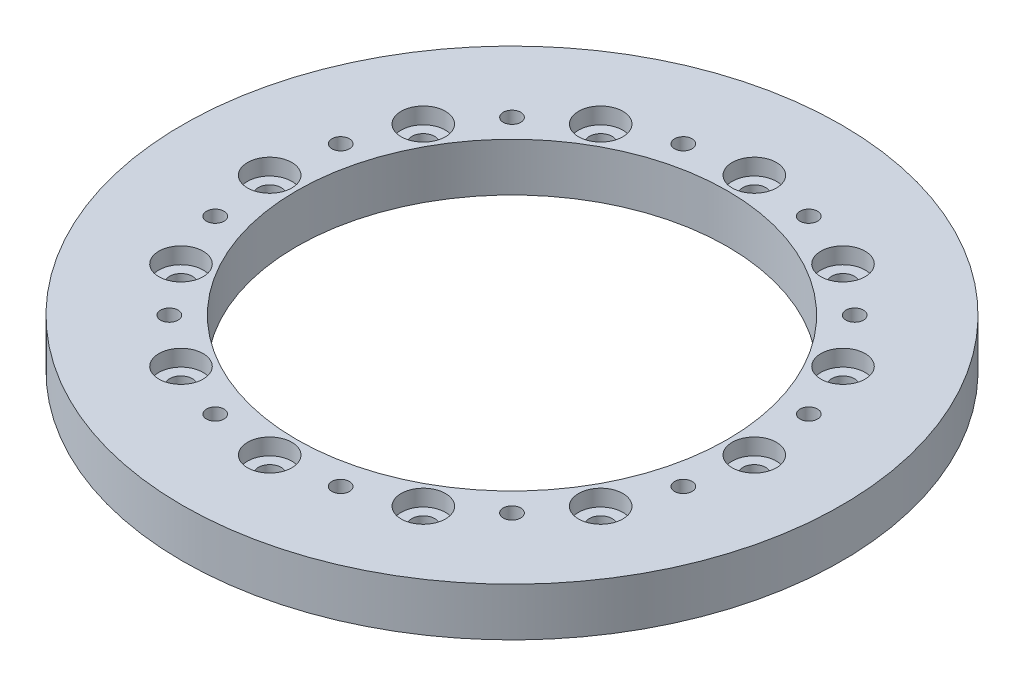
ISO-10303-21;
HEADER;
FILE_DESCRIPTION(('STEP AP214'),'2;1');
FILE_NAME('part.step','',(''),(''),'','','');
FILE_SCHEMA(('AUTOMOTIVE_DESIGN { 1 0 10303 214 1 1 1 1 }'));
ENDSEC;
DATA;
#1=APPLICATION_CONTEXT('core data for automotive mechanical design processes');
#2=APPLICATION_PROTOCOL_DEFINITION('international standard','automotive_design',2000,#1);
#3=PRODUCT_CONTEXT('',#1,'mechanical');
#4=PRODUCT('Part','Part','',(#3));
#5=PRODUCT_RELATED_PRODUCT_CATEGORY('part','',(#4));
#6=PRODUCT_DEFINITION_FORMATION('','',#4);
#7=PRODUCT_DEFINITION_CONTEXT('part definition',#1,'design');
#8=PRODUCT_DEFINITION('design','',#6,#7);
#9=PRODUCT_DEFINITION_SHAPE('','',#8);
#10=(LENGTH_UNIT() NAMED_UNIT(*) SI_UNIT(.MILLI.,.METRE.));
#11=(NAMED_UNIT(*) PLANE_ANGLE_UNIT() SI_UNIT($,.RADIAN.));
#12=(NAMED_UNIT(*) SI_UNIT($,.STERADIAN.) SOLID_ANGLE_UNIT());
#13=UNCERTAINTY_MEASURE_WITH_UNIT(LENGTH_MEASURE(1.E-05),#10,'distance_accuracy_value','');
#14=(GEOMETRIC_REPRESENTATION_CONTEXT(3) GLOBAL_UNCERTAINTY_ASSIGNED_CONTEXT((#13)) GLOBAL_UNIT_ASSIGNED_CONTEXT((#10,
#11,#12)) REPRESENTATION_CONTEXT('',''));
#15=CARTESIAN_POINT('',(0.,0.,0.));
#16=DIRECTION('',(0.,0.,1.));
#17=DIRECTION('',(1.,0.,0.));
#18=AXIS2_PLACEMENT_3D('',#15,#16,#17);
#19=CARTESIAN_POINT('',(0.,9.525,0.));
#20=DIRECTION('',(0.,1.,0.));
#21=DIRECTION('',(0.,0.,1.));
#22=AXIS2_PLACEMENT_3D('',#19,#20,#21);
#23=PLANE('',#22);
#24=CARTESIAN_POINT('',(33.8016840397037,9.525,-33.8016840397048));
#25=DIRECTION('',(0.,1.,0.));
#26=DIRECTION('',(0.,0.,1.));
#27=AXIS2_PLACEMENT_3D('',#24,#25,#26);
#28=CIRCLE('',#27,1.7272);
#29=CARTESIAN_POINT('',(33.8016840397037,9.525,-32.0744840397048));
#30=VERTEX_POINT('',#29);
#31=EDGE_CURVE('E289',#30,#30,#28,.T.);
#32=ORIENTED_EDGE('',*,*,#31,.F.);
#33=EDGE_LOOP('',(#32));
#34=FACE_BOUND('',#33,.T.);
#35=CARTESIAN_POINT('',(46.1739590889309,9.52500000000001,-12.3722750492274));
#36=DIRECTION('',(0.,1.,0.));
#37=DIRECTION('',(0.,0.,1.));
#38=AXIS2_PLACEMENT_3D('',#35,#36,#37);
#39=CIRCLE('',#38,1.7272);
#40=CARTESIAN_POINT('',(46.1739590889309,9.52500000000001,-10.6450750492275));
#41=VERTEX_POINT('',#40);
#42=EDGE_CURVE('E282',#41,#41,#39,.T.);
#43=ORIENTED_EDGE('',*,*,#42,.F.);
#44=EDGE_LOOP('',(#43));
#45=FACE_BOUND('',#44,.T.);
#46=CARTESIAN_POINT('',(46.1739590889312,9.52500000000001,12.3722750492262));
#47=DIRECTION('',(0.,1.,0.));
#48=DIRECTION('',(0.,0.,1.));
#49=AXIS2_PLACEMENT_3D('',#46,#47,#48);
#50=CIRCLE('',#49,1.7272);
#51=CARTESIAN_POINT('',(46.1739590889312,9.52500000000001,14.0994750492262));
#52=VERTEX_POINT('',#51);
#53=EDGE_CURVE('E275',#52,#52,#50,.T.);
#54=ORIENTED_EDGE('',*,*,#53,.F.);
#55=EDGE_LOOP('',(#54));
#56=FACE_BOUND('',#55,.T.);
#57=CARTESIAN_POINT('',(33.8016840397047,9.52500000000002,33.8016840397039));
#58=DIRECTION('',(0.,1.,0.));
#59=DIRECTION('',(0.,0.,1.));
#60=AXIS2_PLACEMENT_3D('',#57,#58,#59);
#61=CIRCLE('',#60,1.7272);
#62=CARTESIAN_POINT('',(33.8016840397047,9.52500000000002,35.5288840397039));
#63=VERTEX_POINT('',#62);
#64=EDGE_CURVE('E269',#63,#63,#61,.T.);
#65=ORIENTED_EDGE('',*,*,#64,.F.);
#66=EDGE_LOOP('',(#65));
#67=FACE_BOUND('',#66,.T.);
#68=CARTESIAN_POINT('',(12.3722750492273,9.52500000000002,46.1739590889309));
#69=DIRECTION('',(0.,1.,0.));
#70=DIRECTION('',(0.,0.,1.));
#71=AXIS2_PLACEMENT_3D('',#68,#69,#70);
#72=CIRCLE('',#71,1.7272);
#73=CARTESIAN_POINT('',(12.3722750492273,9.52500000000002,47.9011590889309));
#74=VERTEX_POINT('',#73);
#75=EDGE_CURVE('E263',#74,#74,#72,.T.);
#76=ORIENTED_EDGE('',*,*,#75,.F.);
#77=EDGE_LOOP('',(#76));
#78=FACE_BOUND('',#77,.T.);
#79=CARTESIAN_POINT('',(-12.3722750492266,9.52500000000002,46.1739590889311));
#80=DIRECTION('',(0.,1.,0.));
#81=DIRECTION('',(0.,0.,1.));
#82=AXIS2_PLACEMENT_3D('',#79,#80,#81);
#83=CIRCLE('',#82,1.7272);
#84=CARTESIAN_POINT('',(-12.3722750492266,9.52500000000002,47.9011590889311));
#85=VERTEX_POINT('',#84);
#86=EDGE_CURVE('E257',#85,#85,#83,.T.);
#87=ORIENTED_EDGE('',*,*,#86,.F.);
#88=EDGE_LOOP('',(#87));
#89=FACE_BOUND('',#88,.T.);
#90=CARTESIAN_POINT('',(-33.801684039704,9.52500000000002,33.8016840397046));
#91=DIRECTION('',(0.,1.,0.));
#92=DIRECTION('',(0.,0.,1.));
#93=AXIS2_PLACEMENT_3D('',#90,#91,#92);
#94=CIRCLE('',#93,1.7272);
#95=CARTESIAN_POINT('',(-33.801684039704,9.52500000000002,35.5288840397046));
#96=VERTEX_POINT('',#95);
#97=EDGE_CURVE('E251',#96,#96,#94,.T.);
#98=ORIENTED_EDGE('',*,*,#97,.F.);
#99=EDGE_LOOP('',(#98));
#100=FACE_BOUND('',#99,.T.);
#101=CARTESIAN_POINT('',(-46.173959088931,9.52500000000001,12.3722750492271));
#102=DIRECTION('',(0.,1.,0.));
#103=DIRECTION('',(0.,0.,1.));
#104=AXIS2_PLACEMENT_3D('',#101,#102,#103);
#105=CIRCLE('',#104,1.7272);
#106=CARTESIAN_POINT('',(-46.173959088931,9.52500000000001,14.0994750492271));
#107=VERTEX_POINT('',#106);
#108=EDGE_CURVE('E245',#107,#107,#105,.T.);
#109=ORIENTED_EDGE('',*,*,#108,.F.);
#110=EDGE_LOOP('',(#109));
#111=FACE_BOUND('',#110,.T.);
#112=CARTESIAN_POINT('',(-46.1739590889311,9.52500000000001,-12.3722750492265));
#113=DIRECTION('',(0.,1.,0.));
#114=DIRECTION('',(0.,0.,1.));
#115=AXIS2_PLACEMENT_3D('',#112,#113,#114);
#116=CIRCLE('',#115,1.7272);
#117=CARTESIAN_POINT('',(-46.1739590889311,9.52500000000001,-10.6450750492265));
#118=VERTEX_POINT('',#117);
#119=EDGE_CURVE('E238',#118,#118,#116,.T.);
#120=ORIENTED_EDGE('',*,*,#119,.F.);
#121=EDGE_LOOP('',(#120));
#122=FACE_BOUND('',#121,.T.);
#123=CARTESIAN_POINT('',(-33.8016840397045,9.525,-33.8016840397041));
#124=DIRECTION('',(0.,1.,0.));
#125=DIRECTION('',(0.,0.,1.));
#126=AXIS2_PLACEMENT_3D('',#123,#124,#125);
#127=CIRCLE('',#126,1.7272);
#128=CARTESIAN_POINT('',(-33.8016840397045,9.525,-32.0744840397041));
#129=VERTEX_POINT('',#128);
#130=EDGE_CURVE('E232',#129,#129,#127,.T.);
#131=ORIENTED_EDGE('',*,*,#130,.F.);
#132=EDGE_LOOP('',(#131));
#133=FACE_BOUND('',#132,.T.);
#134=CARTESIAN_POINT('',(-12.372275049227,9.525,-46.173959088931));
#135=DIRECTION('',(0.,1.,0.));
#136=DIRECTION('',(0.,0.,1.));
#137=AXIS2_PLACEMENT_3D('',#134,#135,#136);
#138=CIRCLE('',#137,1.7272);
#139=CARTESIAN_POINT('',(-12.372275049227,9.525,-44.446759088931));
#140=VERTEX_POINT('',#139);
#141=EDGE_CURVE('E226',#140,#140,#138,.T.);
#142=ORIENTED_EDGE('',*,*,#141,.F.);
#143=EDGE_LOOP('',(#142));
#144=FACE_BOUND('',#143,.T.);
#145=CARTESIAN_POINT('',(12.3722750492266,9.525,-46.1739590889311));
#146=DIRECTION('',(0.,1.,0.));
#147=DIRECTION('',(0.,0.,1.));
#148=AXIS2_PLACEMENT_3D('',#145,#146,#147);
#149=CIRCLE('',#148,1.7272);
#150=CARTESIAN_POINT('',(12.3722750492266,9.525,-44.4467590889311));
#151=VERTEX_POINT('',#150);
#152=EDGE_CURVE('E220',#151,#151,#149,.T.);
#153=ORIENTED_EDGE('',*,*,#152,.F.);
#154=EDGE_LOOP('',(#153));
#155=FACE_BOUND('',#154,.T.);
#156=CARTESIAN_POINT('',(41.3984391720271,9.52500000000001,23.9013999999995));
#157=DIRECTION('',(0.,1.,0.));
#158=DIRECTION('',(0.,0.,1.));
#159=AXIS2_PLACEMENT_3D('',#156,#157,#158);
#160=CIRCLE('',#159,4.36626);
#161=CARTESIAN_POINT('',(41.3984391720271,9.52500000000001,28.2676599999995));
#162=VERTEX_POINT('',#161);
#163=EDGE_CURVE('E214',#162,#162,#160,.T.);
#164=ORIENTED_EDGE('',*,*,#163,.F.);
#165=EDGE_LOOP('',(#164));
#166=FACE_BOUND('',#165,.T.);
#167=CARTESIAN_POINT('',(23.9014000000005,9.52500000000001,41.3984391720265));
#168=DIRECTION('',(0.,1.,0.));
#169=DIRECTION('',(0.,0.,1.));
#170=AXIS2_PLACEMENT_3D('',#167,#168,#169);
#171=CIRCLE('',#170,4.36626);
#172=CARTESIAN_POINT('',(23.9014000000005,9.52500000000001,45.7646991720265));
#173=VERTEX_POINT('',#172);
#174=EDGE_CURVE('E202',#173,#173,#171,.T.);
#175=ORIENTED_EDGE('',*,*,#174,.F.);
#176=EDGE_LOOP('',(#175));
#177=FACE_BOUND('',#176,.T.);
#178=CARTESIAN_POINT('',(4.98592777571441E-13,9.52500000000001,47.8028));
#179=DIRECTION('',(0.,1.,0.));
#180=DIRECTION('',(0.,0.,1.));
#181=AXIS2_PLACEMENT_3D('',#178,#179,#180);
#182=CIRCLE('',#181,4.36626);
#183=CARTESIAN_POINT('',(4.98592777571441E-13,9.52500000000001,52.16906));
#184=VERTEX_POINT('',#183);
#185=EDGE_CURVE('E190',#184,#184,#182,.T.);
#186=ORIENTED_EDGE('',*,*,#185,.F.);
#187=EDGE_LOOP('',(#186));
#188=FACE_BOUND('',#187,.T.);
#189=CARTESIAN_POINT('',(-23.9013999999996,9.52500000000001,41.398439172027));
#190=DIRECTION('',(0.,1.,0.));
#191=DIRECTION('',(0.,0.,1.));
#192=AXIS2_PLACEMENT_3D('',#189,#190,#191);
#193=CIRCLE('',#192,4.36626);
#194=CARTESIAN_POINT('',(-23.9013999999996,9.52500000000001,45.764699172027));
#195=VERTEX_POINT('',#194);
#196=EDGE_CURVE('E178',#195,#195,#193,.T.);
#197=ORIENTED_EDGE('',*,*,#196,.F.);
#198=EDGE_LOOP('',(#197));
#199=FACE_BOUND('',#198,.T.);
#200=CARTESIAN_POINT('',(-41.3984391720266,9.52500000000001,23.9014000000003));
#201=DIRECTION('',(0.,1.,0.));
#202=DIRECTION('',(0.,0.,1.));
#203=AXIS2_PLACEMENT_3D('',#200,#201,#202);
#204=CIRCLE('',#203,4.36626);
#205=CARTESIAN_POINT('',(-41.3984391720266,9.52500000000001,28.2676600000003));
#206=VERTEX_POINT('',#205);
#207=EDGE_CURVE('E166',#206,#206,#204,.T.);
#208=ORIENTED_EDGE('',*,*,#207,.F.);
#209=EDGE_LOOP('',(#208));
#210=FACE_BOUND('',#209,.T.);
#211=CARTESIAN_POINT('',(-47.8028,9.525,0.));
#212=DIRECTION('',(0.,1.,0.));
#213=DIRECTION('',(0.,0.,1.));
#214=AXIS2_PLACEMENT_3D('',#211,#212,#213);
#215=CIRCLE('',#214,4.36626);
#216=CARTESIAN_POINT('',(-47.8028,9.525,4.36625999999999));
#217=VERTEX_POINT('',#216);
#218=EDGE_CURVE('E154',#217,#217,#215,.T.);
#219=ORIENTED_EDGE('',*,*,#218,.F.);
#220=EDGE_LOOP('',(#219));
#221=FACE_BOUND('',#220,.T.);
#222=CARTESIAN_POINT('',(-41.3984391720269,9.525,-23.9013999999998));
#223=DIRECTION('',(0.,1.,0.));
#224=DIRECTION('',(0.,0.,1.));
#225=AXIS2_PLACEMENT_3D('',#222,#223,#224);
#226=CIRCLE('',#225,4.36626);
#227=CARTESIAN_POINT('',(-41.3984391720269,9.525,-19.5351399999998));
#228=VERTEX_POINT('',#227);
#229=EDGE_CURVE('E142',#228,#228,#226,.T.);
#230=ORIENTED_EDGE('',*,*,#229,.F.);
#231=EDGE_LOOP('',(#230));
#232=FACE_BOUND('',#231,.T.);
#233=CARTESIAN_POINT('',(-23.9014000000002,9.52499999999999,-41.3984391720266));
#234=DIRECTION('',(0.,1.,0.));
#235=DIRECTION('',(0.,0.,1.));
#236=AXIS2_PLACEMENT_3D('',#233,#234,#235);
#237=CIRCLE('',#236,4.36626);
#238=CARTESIAN_POINT('',(-23.9014000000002,9.52499999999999,-37.0321791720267));
#239=VERTEX_POINT('',#238);
#240=EDGE_CURVE('E130',#239,#239,#237,.T.);
#241=ORIENTED_EDGE('',*,*,#240,.F.);
#242=EDGE_LOOP('',(#241));
#243=FACE_BOUND('',#242,.T.);
#244=CARTESIAN_POINT('',(-1.6478760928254E-13,9.52499999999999,-47.8028));
#245=DIRECTION('',(0.,1.,0.));
#246=DIRECTION('',(0.,0.,1.));
#247=AXIS2_PLACEMENT_3D('',#244,#245,#246);
#248=CIRCLE('',#247,4.36626);
#249=CARTESIAN_POINT('',(-1.6478760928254E-13,9.52499999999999,-43.43654));
#250=VERTEX_POINT('',#249);
#251=EDGE_CURVE('E118',#250,#250,#248,.T.);
#252=ORIENTED_EDGE('',*,*,#251,.F.);
#253=EDGE_LOOP('',(#252));
#254=FACE_BOUND('',#253,.T.);
#255=CARTESIAN_POINT('',(23.9013999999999,9.52499999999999,-41.3984391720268));
#256=DIRECTION('',(0.,1.,0.));
#257=DIRECTION('',(0.,0.,1.));
#258=AXIS2_PLACEMENT_3D('',#255,#256,#257);
#259=CIRCLE('',#258,4.36626);
#260=CARTESIAN_POINT('',(23.9013999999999,9.52499999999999,-37.0321791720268));
#261=VERTEX_POINT('',#260);
#262=EDGE_CURVE('E105',#261,#261,#259,.T.);
#263=ORIENTED_EDGE('',*,*,#262,.F.);
#264=EDGE_LOOP('',(#263));
#265=FACE_BOUND('',#264,.T.);
#266=CARTESIAN_POINT('',(41.3984391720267,9.525,-23.9014));
#267=DIRECTION('',(0.,1.,0.));
#268=DIRECTION('',(0.,0.,1.));
#269=AXIS2_PLACEMENT_3D('',#266,#267,#268);
#270=CIRCLE('',#269,4.36626);
#271=CARTESIAN_POINT('',(41.3984391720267,9.525,-19.53514));
#272=VERTEX_POINT('',#271);
#273=EDGE_CURVE('E92',#272,#272,#270,.T.);
#274=ORIENTED_EDGE('',*,*,#273,.F.);
#275=EDGE_LOOP('',(#274));
#276=FACE_BOUND('',#275,.T.);
#277=CARTESIAN_POINT('',(47.8028,9.525,0.));
#278=DIRECTION('',(0.,1.,0.));
#279=DIRECTION('',(0.,0.,1.));
#280=AXIS2_PLACEMENT_3D('',#277,#278,#279);
#281=CIRCLE('',#280,4.36626);
#282=CARTESIAN_POINT('',(47.8028,9.525,4.36626));
#283=VERTEX_POINT('',#282);
#284=EDGE_CURVE('E76',#283,#283,#281,.T.);
#285=ORIENTED_EDGE('',*,*,#284,.F.);
#286=EDGE_LOOP('',(#285));
#287=FACE_BOUND('',#286,.T.);
#288=CARTESIAN_POINT('',(0.,9.525,0.));
#289=DIRECTION('',(0.,1.,0.));
#290=DIRECTION('',(0.,0.,1.));
#291=AXIS2_PLACEMENT_3D('',#288,#289,#290);
#292=CIRCLE('',#291,65.0151982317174);
#293=CARTESIAN_POINT('',(0.,9.525,-65.0151982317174));
#294=VERTEX_POINT('',#293);
#295=EDGE_CURVE('E10',#294,#294,#292,.T.);
#296=ORIENTED_EDGE('',*,*,#295,.T.);
#297=EDGE_LOOP('',(#296));
#298=FACE_BOUND('',#297,.T.);
#299=CARTESIAN_POINT('',(0.,9.525,0.));
#300=DIRECTION('',(0.,1.,0.));
#301=DIRECTION('',(0.,0.,1.));
#302=AXIS2_PLACEMENT_3D('',#299,#300,#301);
#303=CIRCLE('',#302,42.5);
#304=CARTESIAN_POINT('',(0.,9.525,-42.5));
#305=VERTEX_POINT('',#304);
#306=EDGE_CURVE('E55',#305,#305,#303,.T.);
#307=ORIENTED_EDGE('',*,*,#306,.F.);
#308=EDGE_LOOP('',(#307));
#309=FACE_BOUND('',#308,.T.);
#310=ADVANCED_FACE('F41',(#34,#45,#56,#67,#78,#89,#100,#111,#122,#133,#144,#155,#166,#177,#188,
#199,#210,#221,#232,#243,#254,#265,#276,#287,#298,#309),#23,.T.);
#311=CARTESIAN_POINT('',(0.,0.,0.));
#312=DIRECTION('',(0.,1.,0.));
#313=DIRECTION('',(0.,0.,1.));
#314=AXIS2_PLACEMENT_3D('',#311,#312,#313);
#315=PLANE('',#314);
#316=CARTESIAN_POINT('',(33.8016840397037,0.,-33.8016840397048));
#317=DIRECTION('',(0.,1.,0.));
#318=DIRECTION('',(0.,0.,1.));
#319=AXIS2_PLACEMENT_3D('',#316,#317,#318);
#320=CIRCLE('',#319,1.7272);
#321=CARTESIAN_POINT('',(33.8016840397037,0.,-32.0744840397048));
#322=VERTEX_POINT('',#321);
#323=EDGE_CURVE('E286',#322,#322,#320,.T.);
#324=ORIENTED_EDGE('',*,*,#323,.T.);
#325=EDGE_LOOP('',(#324));
#326=FACE_BOUND('',#325,.T.);
#327=CARTESIAN_POINT('',(46.1739590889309,0.,-12.3722750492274));
#328=DIRECTION('',(0.,1.,0.));
#329=DIRECTION('',(0.,0.,1.));
#330=AXIS2_PLACEMENT_3D('',#327,#328,#329);
#331=CIRCLE('',#330,1.7272);
#332=CARTESIAN_POINT('',(46.1739590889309,0.,-10.6450750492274));
#333=VERTEX_POINT('',#332);
#334=EDGE_CURVE('E278',#333,#333,#331,.T.);
#335=ORIENTED_EDGE('',*,*,#334,.T.);
#336=EDGE_LOOP('',(#335));
#337=FACE_BOUND('',#336,.T.);
#338=CARTESIAN_POINT('',(46.1739590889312,0.,12.3722750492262));
#339=DIRECTION('',(0.,1.,0.));
#340=DIRECTION('',(0.,0.,1.));
#341=AXIS2_PLACEMENT_3D('',#338,#339,#340);
#342=CIRCLE('',#341,1.7272);
#343=CARTESIAN_POINT('',(46.1739590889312,0.,14.0994750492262));
#344=VERTEX_POINT('',#343);
#345=EDGE_CURVE('E272',#344,#344,#342,.T.);
#346=ORIENTED_EDGE('',*,*,#345,.T.);
#347=EDGE_LOOP('',(#346));
#348=FACE_BOUND('',#347,.T.);
#349=CARTESIAN_POINT('',(33.8016840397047,0.,33.8016840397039));
#350=DIRECTION('',(0.,1.,0.));
#351=DIRECTION('',(0.,0.,1.));
#352=AXIS2_PLACEMENT_3D('',#349,#350,#351);
#353=CIRCLE('',#352,1.7272);
#354=CARTESIAN_POINT('',(33.8016840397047,0.,35.5288840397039));
#355=VERTEX_POINT('',#354);
#356=EDGE_CURVE('E266',#355,#355,#353,.T.);
#357=ORIENTED_EDGE('',*,*,#356,.T.);
#358=EDGE_LOOP('',(#357));
#359=FACE_BOUND('',#358,.T.);
#360=CARTESIAN_POINT('',(12.3722750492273,0.,46.1739590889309));
#361=DIRECTION('',(0.,1.,0.));
#362=DIRECTION('',(0.,0.,1.));
#363=AXIS2_PLACEMENT_3D('',#360,#361,#362);
#364=CIRCLE('',#363,1.7272);
#365=CARTESIAN_POINT('',(12.3722750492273,0.,47.9011590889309));
#366=VERTEX_POINT('',#365);
#367=EDGE_CURVE('E260',#366,#366,#364,.T.);
#368=ORIENTED_EDGE('',*,*,#367,.T.);
#369=EDGE_LOOP('',(#368));
#370=FACE_BOUND('',#369,.T.);
#371=CARTESIAN_POINT('',(-12.3722750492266,0.,46.1739590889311));
#372=DIRECTION('',(0.,1.,0.));
#373=DIRECTION('',(0.,0.,1.));
#374=AXIS2_PLACEMENT_3D('',#371,#372,#373);
#375=CIRCLE('',#374,1.7272);
#376=CARTESIAN_POINT('',(-12.3722750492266,0.,47.9011590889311));
#377=VERTEX_POINT('',#376);
#378=EDGE_CURVE('E254',#377,#377,#375,.T.);
#379=ORIENTED_EDGE('',*,*,#378,.T.);
#380=EDGE_LOOP('',(#379));
#381=FACE_BOUND('',#380,.T.);
#382=CARTESIAN_POINT('',(-33.801684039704,0.,33.8016840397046));
#383=DIRECTION('',(0.,1.,0.));
#384=DIRECTION('',(0.,0.,1.));
#385=AXIS2_PLACEMENT_3D('',#382,#383,#384);
#386=CIRCLE('',#385,1.7272);
#387=CARTESIAN_POINT('',(-33.801684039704,0.,35.5288840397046));
#388=VERTEX_POINT('',#387);
#389=EDGE_CURVE('E248',#388,#388,#386,.T.);
#390=ORIENTED_EDGE('',*,*,#389,.T.);
#391=EDGE_LOOP('',(#390));
#392=FACE_BOUND('',#391,.T.);
#393=CARTESIAN_POINT('',(-46.173959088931,0.,12.3722750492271));
#394=DIRECTION('',(0.,1.,0.));
#395=DIRECTION('',(0.,0.,1.));
#396=AXIS2_PLACEMENT_3D('',#393,#394,#395);
#397=CIRCLE('',#396,1.7272);
#398=CARTESIAN_POINT('',(-46.173959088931,0.,14.0994750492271));
#399=VERTEX_POINT('',#398);
#400=EDGE_CURVE('E241',#399,#399,#397,.T.);
#401=ORIENTED_EDGE('',*,*,#400,.T.);
#402=EDGE_LOOP('',(#401));
#403=FACE_BOUND('',#402,.T.);
#404=CARTESIAN_POINT('',(-46.1739590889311,0.,-12.3722750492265));
#405=DIRECTION('',(0.,1.,0.));
#406=DIRECTION('',(0.,0.,1.));
#407=AXIS2_PLACEMENT_3D('',#404,#405,#406);
#408=CIRCLE('',#407,1.7272);
#409=CARTESIAN_POINT('',(-46.1739590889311,0.,-10.6450750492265));
#410=VERTEX_POINT('',#409);
#411=EDGE_CURVE('E235',#410,#410,#408,.T.);
#412=ORIENTED_EDGE('',*,*,#411,.T.);
#413=EDGE_LOOP('',(#412));
#414=FACE_BOUND('',#413,.T.);
#415=CARTESIAN_POINT('',(-33.8016840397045,0.,-33.8016840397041));
#416=DIRECTION('',(0.,1.,0.));
#417=DIRECTION('',(0.,0.,1.));
#418=AXIS2_PLACEMENT_3D('',#415,#416,#417);
#419=CIRCLE('',#418,1.7272);
#420=CARTESIAN_POINT('',(-33.8016840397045,0.,-32.0744840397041));
#421=VERTEX_POINT('',#420);
#422=EDGE_CURVE('E229',#421,#421,#419,.T.);
#423=ORIENTED_EDGE('',*,*,#422,.T.);
#424=EDGE_LOOP('',(#423));
#425=FACE_BOUND('',#424,.T.);
#426=CARTESIAN_POINT('',(-12.372275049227,0.,-46.173959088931));
#427=DIRECTION('',(0.,1.,0.));
#428=DIRECTION('',(0.,0.,1.));
#429=AXIS2_PLACEMENT_3D('',#426,#427,#428);
#430=CIRCLE('',#429,1.7272);
#431=CARTESIAN_POINT('',(-12.372275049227,0.,-44.446759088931));
#432=VERTEX_POINT('',#431);
#433=EDGE_CURVE('E223',#432,#432,#430,.T.);
#434=ORIENTED_EDGE('',*,*,#433,.T.);
#435=EDGE_LOOP('',(#434));
#436=FACE_BOUND('',#435,.T.);
#437=CARTESIAN_POINT('',(12.3722750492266,0.,-46.1739590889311));
#438=DIRECTION('',(0.,1.,0.));
#439=DIRECTION('',(0.,0.,1.));
#440=AXIS2_PLACEMENT_3D('',#437,#438,#439);
#441=CIRCLE('',#440,1.7272);
#442=CARTESIAN_POINT('',(12.3722750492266,0.,-44.4467590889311));
#443=VERTEX_POINT('',#442);
#444=EDGE_CURVE('E217',#443,#443,#441,.T.);
#445=ORIENTED_EDGE('',*,*,#444,.T.);
#446=EDGE_LOOP('',(#445));
#447=FACE_BOUND('',#446,.T.);
#448=CARTESIAN_POINT('',(41.3984391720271,0.,23.9013999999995));
#449=DIRECTION('',(0.,1.,0.));
#450=DIRECTION('',(0.,0.,1.));
#451=AXIS2_PLACEMENT_3D('',#448,#449,#450);
#452=CIRCLE('',#451,2.2479);
#453=CARTESIAN_POINT('',(41.3984391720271,0.,26.1492999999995));
#454=VERTEX_POINT('',#453);
#455=EDGE_CURVE('E205',#454,#454,#452,.T.);
#456=ORIENTED_EDGE('',*,*,#455,.T.);
#457=EDGE_LOOP('',(#456));
#458=FACE_BOUND('',#457,.T.);
#459=CARTESIAN_POINT('',(23.9014000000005,0.,41.3984391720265));
#460=DIRECTION('',(0.,1.,0.));
#461=DIRECTION('',(0.,0.,1.));
#462=AXIS2_PLACEMENT_3D('',#459,#460,#461);
#463=CIRCLE('',#462,2.2479);
#464=CARTESIAN_POINT('',(23.9014000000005,0.,43.6463391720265));
#465=VERTEX_POINT('',#464);
#466=EDGE_CURVE('E193',#465,#465,#463,.T.);
#467=ORIENTED_EDGE('',*,*,#466,.T.);
#468=EDGE_LOOP('',(#467));
#469=FACE_BOUND('',#468,.T.);
#470=CARTESIAN_POINT('',(4.98592777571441E-13,0.,47.8028));
#471=DIRECTION('',(0.,1.,0.));
#472=DIRECTION('',(0.,0.,1.));
#473=AXIS2_PLACEMENT_3D('',#470,#471,#472);
#474=CIRCLE('',#473,2.2479);
#475=CARTESIAN_POINT('',(4.98592777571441E-13,0.,50.0507));
#476=VERTEX_POINT('',#475);
#477=EDGE_CURVE('E181',#476,#476,#474,.T.);
#478=ORIENTED_EDGE('',*,*,#477,.T.);
#479=EDGE_LOOP('',(#478));
#480=FACE_BOUND('',#479,.T.);
#481=CARTESIAN_POINT('',(-23.9013999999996,0.,41.398439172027));
#482=DIRECTION('',(0.,1.,0.));
#483=DIRECTION('',(0.,0.,1.));
#484=AXIS2_PLACEMENT_3D('',#481,#482,#483);
#485=CIRCLE('',#484,2.2479);
#486=CARTESIAN_POINT('',(-23.9013999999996,0.,43.646339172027));
#487=VERTEX_POINT('',#486);
#488=EDGE_CURVE('E169',#487,#487,#485,.T.);
#489=ORIENTED_EDGE('',*,*,#488,.T.);
#490=EDGE_LOOP('',(#489));
#491=FACE_BOUND('',#490,.T.);
#492=CARTESIAN_POINT('',(-41.3984391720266,0.,23.9014000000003));
#493=DIRECTION('',(0.,1.,0.));
#494=DIRECTION('',(0.,0.,1.));
#495=AXIS2_PLACEMENT_3D('',#492,#493,#494);
#496=CIRCLE('',#495,2.2479);
#497=CARTESIAN_POINT('',(-41.3984391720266,0.,26.1493000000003));
#498=VERTEX_POINT('',#497);
#499=EDGE_CURVE('E157',#498,#498,#496,.T.);
#500=ORIENTED_EDGE('',*,*,#499,.T.);
#501=EDGE_LOOP('',(#500));
#502=FACE_BOUND('',#501,.T.);
#503=CARTESIAN_POINT('',(-47.8028,0.,0.));
#504=DIRECTION('',(0.,1.,0.));
#505=DIRECTION('',(0.,0.,1.));
#506=AXIS2_PLACEMENT_3D('',#503,#504,#505);
#507=CIRCLE('',#506,2.2479);
#508=CARTESIAN_POINT('',(-47.8028,0.,2.2479));
#509=VERTEX_POINT('',#508);
#510=EDGE_CURVE('E145',#509,#509,#507,.T.);
#511=ORIENTED_EDGE('',*,*,#510,.T.);
#512=EDGE_LOOP('',(#511));
#513=FACE_BOUND('',#512,.T.);
#514=CARTESIAN_POINT('',(-41.3984391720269,0.,-23.9013999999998));
#515=DIRECTION('',(0.,1.,0.));
#516=DIRECTION('',(0.,0.,1.));
#517=AXIS2_PLACEMENT_3D('',#514,#515,#516);
#518=CIRCLE('',#517,2.2479);
#519=CARTESIAN_POINT('',(-41.3984391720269,0.,-21.6534999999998));
#520=VERTEX_POINT('',#519);
#521=EDGE_CURVE('E133',#520,#520,#518,.T.);
#522=ORIENTED_EDGE('',*,*,#521,.T.);
#523=EDGE_LOOP('',(#522));
#524=FACE_BOUND('',#523,.T.);
#525=CARTESIAN_POINT('',(-23.9014000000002,0.,-41.3984391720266));
#526=DIRECTION('',(0.,1.,0.));
#527=DIRECTION('',(0.,0.,1.));
#528=AXIS2_PLACEMENT_3D('',#525,#526,#527);
#529=CIRCLE('',#528,2.2479);
#530=CARTESIAN_POINT('',(-23.9014000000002,0.,-39.1505391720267));
#531=VERTEX_POINT('',#530);
#532=EDGE_CURVE('E121',#531,#531,#529,.T.);
#533=ORIENTED_EDGE('',*,*,#532,.T.);
#534=EDGE_LOOP('',(#533));
#535=FACE_BOUND('',#534,.T.);
#536=CARTESIAN_POINT('',(-1.6478760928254E-13,0.,-47.8028));
#537=DIRECTION('',(0.,1.,0.));
#538=DIRECTION('',(0.,0.,1.));
#539=AXIS2_PLACEMENT_3D('',#536,#537,#538);
#540=CIRCLE('',#539,2.2479);
#541=CARTESIAN_POINT('',(-1.6478760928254E-13,0.,-45.5549));
#542=VERTEX_POINT('',#541);
#543=EDGE_CURVE('E108',#542,#542,#540,.T.);
#544=ORIENTED_EDGE('',*,*,#543,.T.);
#545=EDGE_LOOP('',(#544));
#546=FACE_BOUND('',#545,.T.);
#547=CARTESIAN_POINT('',(23.9013999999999,0.,-41.3984391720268));
#548=DIRECTION('',(0.,1.,0.));
#549=DIRECTION('',(0.,0.,1.));
#550=AXIS2_PLACEMENT_3D('',#547,#548,#549);
#551=CIRCLE('',#550,2.2479);
#552=CARTESIAN_POINT('',(23.9013999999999,0.,-39.1505391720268));
#553=VERTEX_POINT('',#552);
#554=EDGE_CURVE('E96',#553,#553,#551,.T.);
#555=ORIENTED_EDGE('',*,*,#554,.T.);
#556=EDGE_LOOP('',(#555));
#557=FACE_BOUND('',#556,.T.);
#558=CARTESIAN_POINT('',(41.3984391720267,0.,-23.9014));
#559=DIRECTION('',(0.,1.,0.));
#560=DIRECTION('',(0.,0.,1.));
#561=AXIS2_PLACEMENT_3D('',#558,#559,#560);
#562=CIRCLE('',#561,2.2479);
#563=CARTESIAN_POINT('',(41.3984391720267,0.,-21.6535));
#564=VERTEX_POINT('',#563);
#565=EDGE_CURVE('E80',#564,#564,#562,.T.);
#566=ORIENTED_EDGE('',*,*,#565,.T.);
#567=EDGE_LOOP('',(#566));
#568=FACE_BOUND('',#567,.T.);
#569=CARTESIAN_POINT('',(47.8028,0.,0.));
#570=DIRECTION('',(0.,1.,0.));
#571=DIRECTION('',(0.,0.,1.));
#572=AXIS2_PLACEMENT_3D('',#569,#570,#571);
#573=CIRCLE('',#572,2.2479);
#574=CARTESIAN_POINT('',(47.8028,0.,2.2479));
#575=VERTEX_POINT('',#574);
#576=EDGE_CURVE('E61',#575,#575,#573,.T.);
#577=ORIENTED_EDGE('',*,*,#576,.T.);
#578=EDGE_LOOP('',(#577));
#579=FACE_BOUND('',#578,.T.);
#580=CARTESIAN_POINT('',(0.,0.,0.));
#581=DIRECTION('',(0.,1.,0.));
#582=DIRECTION('',(0.,0.,1.));
#583=AXIS2_PLACEMENT_3D('',#580,#581,#582);
#584=CIRCLE('',#583,65.0151982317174);
#585=CARTESIAN_POINT('',(0.,0.,-65.0151982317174));
#586=VERTEX_POINT('',#585);
#587=EDGE_CURVE('E45',#586,#586,#584,.T.);
#588=ORIENTED_EDGE('',*,*,#587,.F.);
#589=EDGE_LOOP('',(#588));
#590=FACE_BOUND('',#589,.T.);
#591=CARTESIAN_POINT('',(0.,0.,0.));
#592=DIRECTION('',(0.,1.,0.));
#593=DIRECTION('',(0.,0.,1.));
#594=AXIS2_PLACEMENT_3D('',#591,#592,#593);
#595=CIRCLE('',#594,42.5);
#596=CARTESIAN_POINT('',(0.,0.,-42.5));
#597=VERTEX_POINT('',#596);
#598=EDGE_CURVE('E57',#597,#597,#595,.T.);
#599=ORIENTED_EDGE('',*,*,#598,.T.);
#600=EDGE_LOOP('',(#599));
#601=FACE_BOUND('',#600,.T.);
#602=ADVANCED_FACE('F298',(#326,#337,#348,#359,#370,#381,#392,#403,#414,#425,#436,#447,#458,
#469,#480,#491,#502,#513,#524,#535,#546,#557,#568,#579,#590,#601),#315,.F.);
#603=CARTESIAN_POINT('',(0.,9.525,0.));
#604=DIRECTION('',(0.,-1.,0.));
#605=DIRECTION('',(0.,0.,-1.));
#606=AXIS2_PLACEMENT_3D('',#603,#604,#605);
#607=CYLINDRICAL_SURFACE('',#606,65.0151982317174);
#608=CARTESIAN_POINT('',(0.,9.525,-65.0151982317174));
#609=CARTESIAN_POINT('',(0.,9.42578125,-65.0151982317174));
#610=CARTESIAN_POINT('',(0.,9.3265625,-65.0151982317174));
#611=CARTESIAN_POINT('',(0.,9.128125,-65.0151982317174));
#612=CARTESIAN_POINT('',(0.,9.02890625,-65.0151982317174));
#613=CARTESIAN_POINT('',(0.,8.83046875,-65.0151982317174));
#614=CARTESIAN_POINT('',(0.,8.73125,-65.0151982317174));
#615=CARTESIAN_POINT('',(0.,8.5328125,-65.0151982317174));
#616=CARTESIAN_POINT('',(0.,8.43359375,-65.0151982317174));
#617=CARTESIAN_POINT('',(0.,8.23515625,-65.0151982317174));
#618=CARTESIAN_POINT('',(0.,8.1359375,-65.0151982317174));
#619=CARTESIAN_POINT('',(0.,7.9375,-65.0151982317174));
#620=CARTESIAN_POINT('',(0.,7.83828125,-65.0151982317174));
#621=CARTESIAN_POINT('',(0.,7.63984375,-65.0151982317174));
#622=CARTESIAN_POINT('',(0.,7.540625,-65.0151982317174));
#623=CARTESIAN_POINT('',(0.,7.3421875,-65.0151982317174));
#624=CARTESIAN_POINT('',(0.,7.24296875,-65.0151982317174));
#625=CARTESIAN_POINT('',(0.,7.04453125,-65.0151982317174));
#626=CARTESIAN_POINT('',(0.,6.9453125,-65.0151982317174));
#627=CARTESIAN_POINT('',(0.,6.746875,-65.0151982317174));
#628=CARTESIAN_POINT('',(0.,6.64765625,-65.0151982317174));
#629=CARTESIAN_POINT('',(0.,6.44921875,-65.0151982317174));
#630=CARTESIAN_POINT('',(0.,6.35,-65.0151982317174));
#631=CARTESIAN_POINT('',(0.,6.1515625,-65.0151982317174));
#632=CARTESIAN_POINT('',(0.,6.05234375,-65.0151982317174));
#633=CARTESIAN_POINT('',(0.,5.85390625,-65.0151982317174));
#634=CARTESIAN_POINT('',(0.,5.7546875,-65.0151982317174));
#635=CARTESIAN_POINT('',(0.,5.55625,-65.0151982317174));
#636=CARTESIAN_POINT('',(0.,5.45703125,-65.0151982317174));
#637=CARTESIAN_POINT('',(0.,5.25859375,-65.0151982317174));
#638=CARTESIAN_POINT('',(0.,5.159375,-65.0151982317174));
#639=CARTESIAN_POINT('',(0.,4.9609375,-65.0151982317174));
#640=CARTESIAN_POINT('',(0.,4.86171875,-65.0151982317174));
#641=CARTESIAN_POINT('',(0.,4.66328125,-65.0151982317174));
#642=CARTESIAN_POINT('',(0.,4.5640625,-65.0151982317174));
#643=CARTESIAN_POINT('',(0.,4.365625,-65.0151982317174));
#644=CARTESIAN_POINT('',(0.,4.26640625,-65.0151982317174));
#645=CARTESIAN_POINT('',(0.,4.06796875,-65.0151982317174));
#646=CARTESIAN_POINT('',(0.,3.96875,-65.0151982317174));
#647=CARTESIAN_POINT('',(0.,3.7703125,-65.0151982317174));
#648=CARTESIAN_POINT('',(0.,3.67109375,-65.0151982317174));
#649=CARTESIAN_POINT('',(0.,3.47265625,-65.0151982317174));
#650=CARTESIAN_POINT('',(0.,3.3734375,-65.0151982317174));
#651=CARTESIAN_POINT('',(0.,3.175,-65.0151982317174));
#652=CARTESIAN_POINT('',(0.,3.07578125,-65.0151982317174));
#653=CARTESIAN_POINT('',(0.,2.87734375,-65.0151982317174));
#654=CARTESIAN_POINT('',(0.,2.778125,-65.0151982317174));
#655=CARTESIAN_POINT('',(0.,2.5796875,-65.0151982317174));
#656=CARTESIAN_POINT('',(0.,2.48046875,-65.0151982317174));
#657=CARTESIAN_POINT('',(0.,2.28203125,-65.0151982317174));
#658=CARTESIAN_POINT('',(0.,2.1828125,-65.0151982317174));
#659=CARTESIAN_POINT('',(0.,1.984375,-65.0151982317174));
#660=CARTESIAN_POINT('',(0.,1.88515625,-65.0151982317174));
#661=CARTESIAN_POINT('',(0.,1.68671875,-65.0151982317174));
#662=CARTESIAN_POINT('',(0.,1.5875,-65.0151982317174));
#663=CARTESIAN_POINT('',(0.,1.3890625,-65.0151982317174));
#664=CARTESIAN_POINT('',(0.,1.28984375,-65.0151982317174));
#665=CARTESIAN_POINT('',(0.,1.09140625,-65.0151982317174));
#666=CARTESIAN_POINT('',(0.,0.992187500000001,-65.0151982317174));
#667=CARTESIAN_POINT('',(0.,0.793750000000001,-65.0151982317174));
#668=CARTESIAN_POINT('',(0.,0.69453125,-65.0151982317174));
#669=CARTESIAN_POINT('',(0.,0.49609375,-65.0151982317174));
#670=CARTESIAN_POINT('',(0.,0.396875,-65.0151982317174));
#671=CARTESIAN_POINT('',(0.,0.1984375,-65.0151982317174));
#672=CARTESIAN_POINT('',(0.,0.0992187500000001,-65.0151982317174));
#673=CARTESIAN_POINT('',(0.,0.,-65.0151982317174));
#674=B_SPLINE_CURVE_WITH_KNOTS('',3,(#608,#609,#610,#611,#612,#613,#614,#615,#616,#617,#618,
#619,#620,#621,#622,#623,#624,#625,#626,#627,#628,#629,#630,#631,#632,#633,#634,#635,#636,#637,
#638,#639,#640,#641,#642,#643,#644,#645,#646,#647,#648,#649,#650,#651,#652,#653,#654,#655,#656,
#657,#658,#659,#660,#661,#662,#663,#664,#665,#666,#667,#668,#669,#670,#671,#672,#673),
.UNSPECIFIED.,.F.,.F.,(4,2,2,2,2,2,2,2,2,2,2,2,2,2,2,2,2,2,2,2,2,2,2,2,2,2,2,2,2,2,2,2,4),(0.,
0.297656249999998,0.595312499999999,0.892968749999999,1.190625,1.48828125,1.7859375,2.08359375,
2.38125,2.67890625,2.9765625,3.27421875,3.571875,3.86953125,4.1671875,4.46484375,4.7625,
5.06015625,5.3578125,5.65546875,5.953125,6.25078125,6.5484375,6.84609375,7.14375,7.44140625,
7.7390625,8.03671875,8.334375,8.63203125,8.9296875,9.22734375,9.525),.UNSPECIFIED.);
#675=EDGE_CURVE('BSEAM43',#294,#586,#674,.T.);
#676=ORIENTED_EDGE('',*,*,#295,.F.);
#677=ORIENTED_EDGE('',*,*,#587,.T.);
#678=ORIENTED_EDGE('',*,*,#675,.T.);
#679=ORIENTED_EDGE('',*,*,#675,.F.);
#680=EDGE_LOOP('',(#676,#678,#677,#679));
#681=FACE_BOUND('',#680,.T.);
#682=ADVANCED_FACE('F43',(#681),#607,.T.);
#683=CARTESIAN_POINT('',(0.,9.525,0.));
#684=DIRECTION('',(0.,-1.,0.));
#685=DIRECTION('',(0.,0.,-1.));
#686=AXIS2_PLACEMENT_3D('',#683,#684,#685);
#687=CYLINDRICAL_SURFACE('',#686,42.5);
#688=CARTESIAN_POINT('',(0.,9.525,-42.5));
#689=CARTESIAN_POINT('',(0.,9.42578125,-42.5));
#690=CARTESIAN_POINT('',(0.,9.3265625,-42.5));
#691=CARTESIAN_POINT('',(0.,9.128125,-42.5));
#692=CARTESIAN_POINT('',(0.,9.02890625,-42.5));
#693=CARTESIAN_POINT('',(0.,8.83046875,-42.5));
#694=CARTESIAN_POINT('',(0.,8.73125,-42.5));
#695=CARTESIAN_POINT('',(0.,8.5328125,-42.5));
#696=CARTESIAN_POINT('',(0.,8.43359375,-42.5));
#697=CARTESIAN_POINT('',(0.,8.23515625,-42.5));
#698=CARTESIAN_POINT('',(0.,8.1359375,-42.5));
#699=CARTESIAN_POINT('',(0.,7.9375,-42.5));
#700=CARTESIAN_POINT('',(0.,7.83828125,-42.5));
#701=CARTESIAN_POINT('',(0.,7.63984375,-42.5));
#702=CARTESIAN_POINT('',(0.,7.540625,-42.5));
#703=CARTESIAN_POINT('',(0.,7.3421875,-42.5));
#704=CARTESIAN_POINT('',(0.,7.24296875,-42.5));
#705=CARTESIAN_POINT('',(0.,7.04453125,-42.5));
#706=CARTESIAN_POINT('',(0.,6.9453125,-42.5));
#707=CARTESIAN_POINT('',(0.,6.746875,-42.5));
#708=CARTESIAN_POINT('',(0.,6.64765625,-42.5));
#709=CARTESIAN_POINT('',(0.,6.44921875,-42.5));
#710=CARTESIAN_POINT('',(0.,6.35,-42.5));
#711=CARTESIAN_POINT('',(0.,6.1515625,-42.5));
#712=CARTESIAN_POINT('',(0.,6.05234375,-42.5));
#713=CARTESIAN_POINT('',(0.,5.85390625,-42.5));
#714=CARTESIAN_POINT('',(0.,5.7546875,-42.5));
#715=CARTESIAN_POINT('',(0.,5.55625,-42.5));
#716=CARTESIAN_POINT('',(0.,5.45703125,-42.5));
#717=CARTESIAN_POINT('',(0.,5.25859375,-42.5));
#718=CARTESIAN_POINT('',(0.,5.159375,-42.5));
#719=CARTESIAN_POINT('',(0.,4.9609375,-42.5));
#720=CARTESIAN_POINT('',(0.,4.86171875,-42.5));
#721=CARTESIAN_POINT('',(0.,4.66328125,-42.5));
#722=CARTESIAN_POINT('',(0.,4.5640625,-42.5));
#723=CARTESIAN_POINT('',(0.,4.365625,-42.5));
#724=CARTESIAN_POINT('',(0.,4.26640625,-42.5));
#725=CARTESIAN_POINT('',(0.,4.06796875,-42.5));
#726=CARTESIAN_POINT('',(0.,3.96875,-42.5));
#727=CARTESIAN_POINT('',(0.,3.7703125,-42.5));
#728=CARTESIAN_POINT('',(0.,3.67109375,-42.5));
#729=CARTESIAN_POINT('',(0.,3.47265625,-42.5));
#730=CARTESIAN_POINT('',(0.,3.3734375,-42.5));
#731=CARTESIAN_POINT('',(0.,3.175,-42.5));
#732=CARTESIAN_POINT('',(0.,3.07578125,-42.5));
#733=CARTESIAN_POINT('',(0.,2.87734375,-42.5));
#734=CARTESIAN_POINT('',(0.,2.778125,-42.5));
#735=CARTESIAN_POINT('',(0.,2.5796875,-42.5));
#736=CARTESIAN_POINT('',(0.,2.48046875,-42.5));
#737=CARTESIAN_POINT('',(0.,2.28203125,-42.5));
#738=CARTESIAN_POINT('',(0.,2.1828125,-42.5));
#739=CARTESIAN_POINT('',(0.,1.984375,-42.5));
#740=CARTESIAN_POINT('',(0.,1.88515625,-42.5));
#741=CARTESIAN_POINT('',(0.,1.68671875,-42.5));
#742=CARTESIAN_POINT('',(0.,1.5875,-42.5));
#743=CARTESIAN_POINT('',(0.,1.3890625,-42.5));
#744=CARTESIAN_POINT('',(0.,1.28984375,-42.5));
#745=CARTESIAN_POINT('',(0.,1.09140625,-42.5));
#746=CARTESIAN_POINT('',(0.,0.992187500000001,-42.5));
#747=CARTESIAN_POINT('',(0.,0.793750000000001,-42.5));
#748=CARTESIAN_POINT('',(0.,0.69453125,-42.5));
#749=CARTESIAN_POINT('',(0.,0.49609375,-42.5));
#750=CARTESIAN_POINT('',(0.,0.396875,-42.5));
#751=CARTESIAN_POINT('',(0.,0.1984375,-42.5));
#752=CARTESIAN_POINT('',(0.,0.0992187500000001,-42.5));
#753=CARTESIAN_POINT('',(0.,0.,-42.5));
#754=B_SPLINE_CURVE_WITH_KNOTS('',3,(#688,#689,#690,#691,#692,#693,#694,#695,#696,#697,#698,
#699,#700,#701,#702,#703,#704,#705,#706,#707,#708,#709,#710,#711,#712,#713,#714,#715,#716,#717,
#718,#719,#720,#721,#722,#723,#724,#725,#726,#727,#728,#729,#730,#731,#732,#733,#734,#735,#736,
#737,#738,#739,#740,#741,#742,#743,#744,#745,#746,#747,#748,#749,#750,#751,#752,#753),
.UNSPECIFIED.,.F.,.F.,(4,2,2,2,2,2,2,2,2,2,2,2,2,2,2,2,2,2,2,2,2,2,2,2,2,2,2,2,2,2,2,2,4),(0.,
0.297656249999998,0.595312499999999,0.892968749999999,1.190625,1.48828125,1.7859375,2.08359375,
2.38125,2.67890625,2.9765625,3.27421875,3.571875,3.86953125,4.1671875,4.46484375,4.7625,
5.06015625,5.3578125,5.65546875,5.953125,6.25078125,6.5484375,6.84609375,7.14375,7.44140625,
7.7390625,8.03671875,8.334375,8.63203125,8.9296875,9.22734375,9.525),.UNSPECIFIED.);
#755=EDGE_CURVE('BSEAM348',#305,#597,#754,.T.);
#756=ORIENTED_EDGE('',*,*,#306,.T.);
#757=ORIENTED_EDGE('',*,*,#598,.F.);
#758=ORIENTED_EDGE('',*,*,#755,.T.);
#759=ORIENTED_EDGE('',*,*,#755,.F.);
#760=EDGE_LOOP('',(#756,#758,#757,#759));
#761=FACE_BOUND('',#760,.T.);
#762=ADVANCED_FACE('F348',(#761),#687,.F.);
#763=CARTESIAN_POINT('',(47.8028,9.525,0.));
#764=DIRECTION('',(0.,1.,0.));
#765=DIRECTION('',(0.,0.,1.));
#766=AXIS2_PLACEMENT_3D('',#763,#764,#765);
#767=CYLINDRICAL_SURFACE('',#766,2.2479);
#768=ORIENTED_EDGE('',*,*,#576,.F.);
#769=EDGE_LOOP('',(#768));
#770=FACE_BOUND('',#769,.T.);
#771=CARTESIAN_POINT('',(47.8028,6.2992,0.));
#772=DIRECTION('',(0.,1.,0.));
#773=DIRECTION('',(0.,0.,1.));
#774=AXIS2_PLACEMENT_3D('',#771,#772,#773);
#775=CIRCLE('',#774,2.2479);
#776=CARTESIAN_POINT('',(47.8028,6.2992,2.2479));
#777=VERTEX_POINT('',#776);
#778=EDGE_CURVE('E68',#777,#777,#775,.T.);
#779=ORIENTED_EDGE('',*,*,#778,.T.);
#780=EDGE_LOOP('',(#779));
#781=FACE_BOUND('',#780,.T.);
#782=ADVANCED_FACE('F351',(#770,#781),#767,.F.);
#783=CARTESIAN_POINT('',(50.0507,6.2992,0.));
#784=DIRECTION('',(0.,-1.,0.));
#785=DIRECTION('',(0.,0.,-1.));
#786=AXIS2_PLACEMENT_3D('',#783,#784,#785);
#787=PLANE('',#786);
#788=ORIENTED_EDGE('',*,*,#778,.F.);
#789=EDGE_LOOP('',(#788));
#790=FACE_BOUND('',#789,.T.);
#791=CARTESIAN_POINT('',(47.8028,6.2992,0.));
#792=DIRECTION('',(0.,1.,0.));
#793=DIRECTION('',(0.,0.,1.));
#794=AXIS2_PLACEMENT_3D('',#791,#792,#793);
#795=CIRCLE('',#794,4.36626);
#796=CARTESIAN_POINT('',(47.8028,6.2992,4.36626));
#797=VERTEX_POINT('',#796);
#798=EDGE_CURVE('E72',#797,#797,#795,.T.);
#799=ORIENTED_EDGE('',*,*,#798,.T.);
#800=EDGE_LOOP('',(#799));
#801=FACE_BOUND('',#800,.T.);
#802=ADVANCED_FACE('F365',(#790,#801),#787,.F.);
#803=CARTESIAN_POINT('',(47.8028,9.525,0.));
#804=DIRECTION('',(0.,1.,0.));
#805=DIRECTION('',(0.,0.,1.));
#806=AXIS2_PLACEMENT_3D('',#803,#804,#805);
#807=CYLINDRICAL_SURFACE('',#806,4.36626);
#808=ORIENTED_EDGE('',*,*,#798,.F.);
#809=EDGE_LOOP('',(#808));
#810=FACE_BOUND('',#809,.T.);
#811=ORIENTED_EDGE('',*,*,#284,.T.);
#812=EDGE_LOOP('',(#811));
#813=FACE_BOUND('',#812,.T.);
#814=ADVANCED_FACE('F369',(#810,#813),#807,.F.);
#815=CARTESIAN_POINT('',(41.3984391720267,9.525,-23.9014));
#816=DIRECTION('',(0.,1.,0.));
#817=DIRECTION('',(0.,0.,1.));
#818=AXIS2_PLACEMENT_3D('',#815,#816,#817);
#819=CYLINDRICAL_SURFACE('',#818,2.2479);
#820=ORIENTED_EDGE('',*,*,#565,.F.);
#821=EDGE_LOOP('',(#820));
#822=FACE_BOUND('',#821,.T.);
#823=CARTESIAN_POINT('',(41.3984391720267,6.2992,-23.9014));
#824=DIRECTION('',(0.,1.,0.));
#825=DIRECTION('',(0.,0.,1.));
#826=AXIS2_PLACEMENT_3D('',#823,#824,#825);
#827=CIRCLE('',#826,2.2479);
#828=CARTESIAN_POINT('',(41.3984391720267,6.2992,-21.6535));
#829=VERTEX_POINT('',#828);
#830=EDGE_CURVE('E84',#829,#829,#827,.T.);
#831=ORIENTED_EDGE('',*,*,#830,.T.);
#832=EDGE_LOOP('',(#831));
#833=FACE_BOUND('',#832,.T.);
#834=ADVANCED_FACE('F373',(#822,#833),#819,.F.);
#835=CARTESIAN_POINT('',(43.6463391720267,6.2992,-23.9014));
#836=DIRECTION('',(0.,-1.,0.));
#837=DIRECTION('',(0.,0.,-1.));
#838=AXIS2_PLACEMENT_3D('',#835,#836,#837);
#839=PLANE('',#838);
#840=ORIENTED_EDGE('',*,*,#830,.F.);
#841=EDGE_LOOP('',(#840));
#842=FACE_BOUND('',#841,.T.);
#843=CARTESIAN_POINT('',(41.3984391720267,6.2992,-23.9014));
#844=DIRECTION('',(0.,1.,0.));
#845=DIRECTION('',(0.,0.,1.));
#846=AXIS2_PLACEMENT_3D('',#843,#844,#845);
#847=CIRCLE('',#846,4.36626);
#848=CARTESIAN_POINT('',(41.3984391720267,6.2992,-19.53514));
#849=VERTEX_POINT('',#848);
#850=EDGE_CURVE('E88',#849,#849,#847,.T.);
#851=ORIENTED_EDGE('',*,*,#850,.T.);
#852=EDGE_LOOP('',(#851));
#853=FACE_BOUND('',#852,.T.);
#854=ADVANCED_FACE('F377',(#842,#853),#839,.F.);
#855=CARTESIAN_POINT('',(41.3984391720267,9.525,-23.9014));
#856=DIRECTION('',(0.,1.,0.));
#857=DIRECTION('',(0.,0.,1.));
#858=AXIS2_PLACEMENT_3D('',#855,#856,#857);
#859=CYLINDRICAL_SURFACE('',#858,4.36626);
#860=ORIENTED_EDGE('',*,*,#850,.F.);
#861=EDGE_LOOP('',(#860));
#862=FACE_BOUND('',#861,.T.);
#863=ORIENTED_EDGE('',*,*,#273,.T.);
#864=EDGE_LOOP('',(#863));
#865=FACE_BOUND('',#864,.T.);
#866=ADVANCED_FACE('F381',(#862,#865),#859,.F.);
#867=CARTESIAN_POINT('',(23.9013999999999,9.52499999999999,-41.3984391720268));
#868=DIRECTION('',(0.,1.,0.));
#869=DIRECTION('',(0.,0.,1.));
#870=AXIS2_PLACEMENT_3D('',#867,#868,#869);
#871=CYLINDRICAL_SURFACE('',#870,2.2479);
#872=ORIENTED_EDGE('',*,*,#554,.F.);
#873=EDGE_LOOP('',(#872));
#874=FACE_BOUND('',#873,.T.);
#875=CARTESIAN_POINT('',(23.9013999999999,6.29919999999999,-41.3984391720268));
#876=DIRECTION('',(0.,1.,0.));
#877=DIRECTION('',(0.,0.,1.));
#878=AXIS2_PLACEMENT_3D('',#875,#876,#877);
#879=CIRCLE('',#878,2.2479);
#880=CARTESIAN_POINT('',(23.9013999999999,6.29919999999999,-39.1505391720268));
#881=VERTEX_POINT('',#880);
#882=EDGE_CURVE('E99',#881,#881,#879,.T.);
#883=ORIENTED_EDGE('',*,*,#882,.T.);
#884=EDGE_LOOP('',(#883));
#885=FACE_BOUND('',#884,.T.);
#886=ADVANCED_FACE('F385',(#874,#885),#871,.F.);
#887=CARTESIAN_POINT('',(26.1492999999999,6.29919999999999,-41.3984391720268));
#888=DIRECTION('',(0.,-1.,0.));
#889=DIRECTION('',(0.,0.,-1.));
#890=AXIS2_PLACEMENT_3D('',#887,#888,#889);
#891=PLANE('',#890);
#892=ORIENTED_EDGE('',*,*,#882,.F.);
#893=EDGE_LOOP('',(#892));
#894=FACE_BOUND('',#893,.T.);
#895=CARTESIAN_POINT('',(23.9013999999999,6.29919999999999,-41.3984391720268));
#896=DIRECTION('',(0.,1.,0.));
#897=DIRECTION('',(0.,0.,1.));
#898=AXIS2_PLACEMENT_3D('',#895,#896,#897);
#899=CIRCLE('',#898,4.36626);
#900=CARTESIAN_POINT('',(23.9013999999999,6.29919999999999,-37.0321791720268));
#901=VERTEX_POINT('',#900);
#902=EDGE_CURVE('E102',#901,#901,#899,.T.);
#903=ORIENTED_EDGE('',*,*,#902,.T.);
#904=EDGE_LOOP('',(#903));
#905=FACE_BOUND('',#904,.T.);
#906=ADVANCED_FACE('F389',(#894,#905),#891,.F.);
#907=CARTESIAN_POINT('',(23.9013999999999,9.52499999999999,-41.3984391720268));
#908=DIRECTION('',(0.,1.,0.));
#909=DIRECTION('',(0.,0.,1.));
#910=AXIS2_PLACEMENT_3D('',#907,#908,#909);
#911=CYLINDRICAL_SURFACE('',#910,4.36626);
#912=ORIENTED_EDGE('',*,*,#902,.F.);
#913=EDGE_LOOP('',(#912));
#914=FACE_BOUND('',#913,.T.);
#915=ORIENTED_EDGE('',*,*,#262,.T.);
#916=EDGE_LOOP('',(#915));
#917=FACE_BOUND('',#916,.T.);
#918=ADVANCED_FACE('F393',(#914,#917),#911,.F.);
#919=CARTESIAN_POINT('',(-1.6478760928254E-13,9.52499999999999,-47.8028));
#920=DIRECTION('',(0.,1.,0.));
#921=DIRECTION('',(0.,0.,1.));
#922=AXIS2_PLACEMENT_3D('',#919,#920,#921);
#923=CYLINDRICAL_SURFACE('',#922,2.2479);
#924=ORIENTED_EDGE('',*,*,#543,.F.);
#925=EDGE_LOOP('',(#924));
#926=FACE_BOUND('',#925,.T.);
#927=CARTESIAN_POINT('',(-1.6478760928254E-13,6.29919999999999,-47.8028));
#928=DIRECTION('',(0.,1.,0.));
#929=DIRECTION('',(0.,0.,1.));
#930=AXIS2_PLACEMENT_3D('',#927,#928,#929);
#931=CIRCLE('',#930,2.2479);
#932=CARTESIAN_POINT('',(-1.6478760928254E-13,6.29919999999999,-45.5549));
#933=VERTEX_POINT('',#932);
#934=EDGE_CURVE('E112',#933,#933,#931,.T.);
#935=ORIENTED_EDGE('',*,*,#934,.T.);
#936=EDGE_LOOP('',(#935));
#937=FACE_BOUND('',#936,.T.);
#938=ADVANCED_FACE('F397',(#926,#937),#923,.F.);
#939=CARTESIAN_POINT('',(2.24789999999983,6.29919999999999,-47.8028));
#940=DIRECTION('',(0.,-1.,0.));
#941=DIRECTION('',(0.,0.,-1.));
#942=AXIS2_PLACEMENT_3D('',#939,#940,#941);
#943=PLANE('',#942);
#944=ORIENTED_EDGE('',*,*,#934,.F.);
#945=EDGE_LOOP('',(#944));
#946=FACE_BOUND('',#945,.T.);
#947=CARTESIAN_POINT('',(-1.6478760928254E-13,6.29919999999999,-47.8028));
#948=DIRECTION('',(0.,1.,0.));
#949=DIRECTION('',(0.,0.,1.));
#950=AXIS2_PLACEMENT_3D('',#947,#948,#949);
#951=CIRCLE('',#950,4.36626);
#952=CARTESIAN_POINT('',(-1.6478760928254E-13,6.29919999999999,-43.43654));
#953=VERTEX_POINT('',#952);
#954=EDGE_CURVE('E115',#953,#953,#951,.T.);
#955=ORIENTED_EDGE('',*,*,#954,.T.);
#956=EDGE_LOOP('',(#955));
#957=FACE_BOUND('',#956,.T.);
#958=ADVANCED_FACE('F401',(#946,#957),#943,.F.);
#959=CARTESIAN_POINT('',(-1.6478760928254E-13,9.52499999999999,-47.8028));
#960=DIRECTION('',(0.,1.,0.));
#961=DIRECTION('',(0.,0.,1.));
#962=AXIS2_PLACEMENT_3D('',#959,#960,#961);
#963=CYLINDRICAL_SURFACE('',#962,4.36626);
#964=ORIENTED_EDGE('',*,*,#954,.F.);
#965=EDGE_LOOP('',(#964));
#966=FACE_BOUND('',#965,.T.);
#967=ORIENTED_EDGE('',*,*,#251,.T.);
#968=EDGE_LOOP('',(#967));
#969=FACE_BOUND('',#968,.T.);
#970=ADVANCED_FACE('F405',(#966,#969),#963,.F.);
#971=CARTESIAN_POINT('',(-23.9014000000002,9.52499999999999,-41.3984391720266));
#972=DIRECTION('',(0.,1.,0.));
#973=DIRECTION('',(0.,0.,1.));
#974=AXIS2_PLACEMENT_3D('',#971,#972,#973);
#975=CYLINDRICAL_SURFACE('',#974,2.2479);
#976=ORIENTED_EDGE('',*,*,#532,.F.);
#977=EDGE_LOOP('',(#976));
#978=FACE_BOUND('',#977,.T.);
#979=CARTESIAN_POINT('',(-23.9014000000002,6.29919999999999,-41.3984391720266));
#980=DIRECTION('',(0.,1.,0.));
#981=DIRECTION('',(0.,0.,1.));
#982=AXIS2_PLACEMENT_3D('',#979,#980,#981);
#983=CIRCLE('',#982,2.2479);
#984=CARTESIAN_POINT('',(-23.9014000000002,6.29919999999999,-39.1505391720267));
#985=VERTEX_POINT('',#984);
#986=EDGE_CURVE('E124',#985,#985,#983,.T.);
#987=ORIENTED_EDGE('',*,*,#986,.T.);
#988=EDGE_LOOP('',(#987));
#989=FACE_BOUND('',#988,.T.);
#990=ADVANCED_FACE('F409',(#978,#989),#975,.F.);
#991=CARTESIAN_POINT('',(-21.6535000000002,6.29919999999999,-41.3984391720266));
#992=DIRECTION('',(0.,-1.,0.));
#993=DIRECTION('',(0.,0.,-1.));
#994=AXIS2_PLACEMENT_3D('',#991,#992,#993);
#995=PLANE('',#994);
#996=ORIENTED_EDGE('',*,*,#986,.F.);
#997=EDGE_LOOP('',(#996));
#998=FACE_BOUND('',#997,.T.);
#999=CARTESIAN_POINT('',(-23.9014000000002,6.29919999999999,-41.3984391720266));
#1000=DIRECTION('',(0.,1.,0.));
#1001=DIRECTION('',(0.,0.,1.));
#1002=AXIS2_PLACEMENT_3D('',#999,#1000,#1001);
#1003=CIRCLE('',#1002,4.36626);
#1004=CARTESIAN_POINT('',(-23.9014000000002,6.29919999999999,-37.0321791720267));
#1005=VERTEX_POINT('',#1004);
#1006=EDGE_CURVE('E127',#1005,#1005,#1003,.T.);
#1007=ORIENTED_EDGE('',*,*,#1006,.T.);
#1008=EDGE_LOOP('',(#1007));
#1009=FACE_BOUND('',#1008,.T.);
#1010=ADVANCED_FACE('F413',(#998,#1009),#995,.F.);
#1011=CARTESIAN_POINT('',(-23.9014000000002,9.52499999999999,-41.3984391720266));
#1012=DIRECTION('',(0.,1.,0.));
#1013=DIRECTION('',(0.,0.,1.));
#1014=AXIS2_PLACEMENT_3D('',#1011,#1012,#1013);
#1015=CYLINDRICAL_SURFACE('',#1014,4.36626);
#1016=ORIENTED_EDGE('',*,*,#1006,.F.);
#1017=EDGE_LOOP('',(#1016));
#1018=FACE_BOUND('',#1017,.T.);
#1019=ORIENTED_EDGE('',*,*,#240,.T.);
#1020=EDGE_LOOP('',(#1019));
#1021=FACE_BOUND('',#1020,.T.);
#1022=ADVANCED_FACE('F417',(#1018,#1021),#1015,.F.);
#1023=CARTESIAN_POINT('',(-41.3984391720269,9.525,-23.9013999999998));
#1024=DIRECTION('',(0.,1.,0.));
#1025=DIRECTION('',(0.,0.,1.));
#1026=AXIS2_PLACEMENT_3D('',#1023,#1024,#1025);
#1027=CYLINDRICAL_SURFACE('',#1026,2.2479);
#1028=ORIENTED_EDGE('',*,*,#521,.F.);
#1029=EDGE_LOOP('',(#1028));
#1030=FACE_BOUND('',#1029,.T.);
#1031=CARTESIAN_POINT('',(-41.3984391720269,6.2992,-23.9013999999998));
#1032=DIRECTION('',(0.,1.,0.));
#1033=DIRECTION('',(0.,0.,1.));
#1034=AXIS2_PLACEMENT_3D('',#1031,#1032,#1033);
#1035=CIRCLE('',#1034,2.2479);
#1036=CARTESIAN_POINT('',(-41.3984391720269,6.2992,-21.6534999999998));
#1037=VERTEX_POINT('',#1036);
#1038=EDGE_CURVE('E136',#1037,#1037,#1035,.T.);
#1039=ORIENTED_EDGE('',*,*,#1038,.T.);
#1040=EDGE_LOOP('',(#1039));
#1041=FACE_BOUND('',#1040,.T.);
#1042=ADVANCED_FACE('F421',(#1030,#1041),#1027,.F.);
#1043=CARTESIAN_POINT('',(-39.1505391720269,6.2992,-23.9013999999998));
#1044=DIRECTION('',(0.,-1.,0.));
#1045=DIRECTION('',(0.,0.,-1.));
#1046=AXIS2_PLACEMENT_3D('',#1043,#1044,#1045);
#1047=PLANE('',#1046);
#1048=ORIENTED_EDGE('',*,*,#1038,.F.);
#1049=EDGE_LOOP('',(#1048));
#1050=FACE_BOUND('',#1049,.T.);
#1051=CARTESIAN_POINT('',(-41.3984391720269,6.2992,-23.9013999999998));
#1052=DIRECTION('',(0.,1.,0.));
#1053=DIRECTION('',(0.,0.,1.));
#1054=AXIS2_PLACEMENT_3D('',#1051,#1052,#1053);
#1055=CIRCLE('',#1054,4.36626);
#1056=CARTESIAN_POINT('',(-41.3984391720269,6.2992,-19.5351399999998));
#1057=VERTEX_POINT('',#1056);
#1058=EDGE_CURVE('E139',#1057,#1057,#1055,.T.);
#1059=ORIENTED_EDGE('',*,*,#1058,.T.);
#1060=EDGE_LOOP('',(#1059));
#1061=FACE_BOUND('',#1060,.T.);
#1062=ADVANCED_FACE('F425',(#1050,#1061),#1047,.F.);
#1063=CARTESIAN_POINT('',(-41.3984391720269,9.525,-23.9013999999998));
#1064=DIRECTION('',(0.,1.,0.));
#1065=DIRECTION('',(0.,0.,1.));
#1066=AXIS2_PLACEMENT_3D('',#1063,#1064,#1065);
#1067=CYLINDRICAL_SURFACE('',#1066,4.36626);
#1068=ORIENTED_EDGE('',*,*,#1058,.F.);
#1069=EDGE_LOOP('',(#1068));
#1070=FACE_BOUND('',#1069,.T.);
#1071=ORIENTED_EDGE('',*,*,#229,.T.);
#1072=EDGE_LOOP('',(#1071));
#1073=FACE_BOUND('',#1072,.T.);
#1074=ADVANCED_FACE('F429',(#1070,#1073),#1067,.F.);
#1075=CARTESIAN_POINT('',(-47.8028,9.525,0.));
#1076=DIRECTION('',(0.,1.,0.));
#1077=DIRECTION('',(0.,0.,1.));
#1078=AXIS2_PLACEMENT_3D('',#1075,#1076,#1077);
#1079=CYLINDRICAL_SURFACE('',#1078,2.2479);
#1080=ORIENTED_EDGE('',*,*,#510,.F.);
#1081=EDGE_LOOP('',(#1080));
#1082=FACE_BOUND('',#1081,.T.);
#1083=CARTESIAN_POINT('',(-47.8028,6.2992,0.));
#1084=DIRECTION('',(0.,1.,0.));
#1085=DIRECTION('',(0.,0.,1.));
#1086=AXIS2_PLACEMENT_3D('',#1083,#1084,#1085);
#1087=CIRCLE('',#1086,2.2479);
#1088=CARTESIAN_POINT('',(-47.8028,6.2992,2.24789999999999));
#1089=VERTEX_POINT('',#1088);
#1090=EDGE_CURVE('E148',#1089,#1089,#1087,.T.);
#1091=ORIENTED_EDGE('',*,*,#1090,.T.);
#1092=EDGE_LOOP('',(#1091));
#1093=FACE_BOUND('',#1092,.T.);
#1094=ADVANCED_FACE('F433',(#1082,#1093),#1079,.F.);
#1095=CARTESIAN_POINT('',(-45.5549,6.2992,0.));
#1096=DIRECTION('',(0.,-1.,0.));
#1097=DIRECTION('',(0.,0.,-1.));
#1098=AXIS2_PLACEMENT_3D('',#1095,#1096,#1097);
#1099=PLANE('',#1098);
#1100=ORIENTED_EDGE('',*,*,#1090,.F.);
#1101=EDGE_LOOP('',(#1100));
#1102=FACE_BOUND('',#1101,.T.);
#1103=CARTESIAN_POINT('',(-47.8028,6.2992,0.));
#1104=DIRECTION('',(0.,1.,0.));
#1105=DIRECTION('',(0.,0.,1.));
#1106=AXIS2_PLACEMENT_3D('',#1103,#1104,#1105);
#1107=CIRCLE('',#1106,4.36626);
#1108=CARTESIAN_POINT('',(-47.8028,6.2992,4.36625999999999));
#1109=VERTEX_POINT('',#1108);
#1110=EDGE_CURVE('E151',#1109,#1109,#1107,.T.);
#1111=ORIENTED_EDGE('',*,*,#1110,.T.);
#1112=EDGE_LOOP('',(#1111));
#1113=FACE_BOUND('',#1112,.T.);
#1114=ADVANCED_FACE('F437',(#1102,#1113),#1099,.F.);
#1115=CARTESIAN_POINT('',(-47.8028,9.525,0.));
#1116=DIRECTION('',(0.,1.,0.));
#1117=DIRECTION('',(0.,0.,1.));
#1118=AXIS2_PLACEMENT_3D('',#1115,#1116,#1117);
#1119=CYLINDRICAL_SURFACE('',#1118,4.36626);
#1120=ORIENTED_EDGE('',*,*,#1110,.F.);
#1121=EDGE_LOOP('',(#1120));
#1122=FACE_BOUND('',#1121,.T.);
#1123=ORIENTED_EDGE('',*,*,#218,.T.);
#1124=EDGE_LOOP('',(#1123));
#1125=FACE_BOUND('',#1124,.T.);
#1126=ADVANCED_FACE('F441',(#1122,#1125),#1119,.F.);
#1127=CARTESIAN_POINT('',(-41.3984391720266,9.52500000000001,23.9014000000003));
#1128=DIRECTION('',(0.,1.,0.));
#1129=DIRECTION('',(0.,0.,1.));
#1130=AXIS2_PLACEMENT_3D('',#1127,#1128,#1129);
#1131=CYLINDRICAL_SURFACE('',#1130,2.2479);
#1132=ORIENTED_EDGE('',*,*,#499,.F.);
#1133=EDGE_LOOP('',(#1132));
#1134=FACE_BOUND('',#1133,.T.);
#1135=CARTESIAN_POINT('',(-41.3984391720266,6.29920000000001,23.9014000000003));
#1136=DIRECTION('',(0.,1.,0.));
#1137=DIRECTION('',(0.,0.,1.));
#1138=AXIS2_PLACEMENT_3D('',#1135,#1136,#1137);
#1139=CIRCLE('',#1138,2.2479);
#1140=CARTESIAN_POINT('',(-41.3984391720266,6.29920000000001,26.1493000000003));
#1141=VERTEX_POINT('',#1140);
#1142=EDGE_CURVE('E160',#1141,#1141,#1139,.T.);
#1143=ORIENTED_EDGE('',*,*,#1142,.T.);
#1144=EDGE_LOOP('',(#1143));
#1145=FACE_BOUND('',#1144,.T.);
#1146=ADVANCED_FACE('F445',(#1134,#1145),#1131,.F.);
#1147=CARTESIAN_POINT('',(-39.1505391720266,6.29920000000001,23.9014000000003));
#1148=DIRECTION('',(0.,-1.,0.));
#1149=DIRECTION('',(0.,0.,-1.));
#1150=AXIS2_PLACEMENT_3D('',#1147,#1148,#1149);
#1151=PLANE('',#1150);
#1152=ORIENTED_EDGE('',*,*,#1142,.F.);
#1153=EDGE_LOOP('',(#1152));
#1154=FACE_BOUND('',#1153,.T.);
#1155=CARTESIAN_POINT('',(-41.3984391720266,6.29920000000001,23.9014000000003));
#1156=DIRECTION('',(0.,1.,0.));
#1157=DIRECTION('',(0.,0.,1.));
#1158=AXIS2_PLACEMENT_3D('',#1155,#1156,#1157);
#1159=CIRCLE('',#1158,4.36626);
#1160=CARTESIAN_POINT('',(-41.3984391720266,6.29920000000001,28.2676600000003));
#1161=VERTEX_POINT('',#1160);
#1162=EDGE_CURVE('E163',#1161,#1161,#1159,.T.);
#1163=ORIENTED_EDGE('',*,*,#1162,.T.);
#1164=EDGE_LOOP('',(#1163));
#1165=FACE_BOUND('',#1164,.T.);
#1166=ADVANCED_FACE('F449',(#1154,#1165),#1151,.F.);
#1167=CARTESIAN_POINT('',(-41.3984391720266,9.52500000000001,23.9014000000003));
#1168=DIRECTION('',(0.,1.,0.));
#1169=DIRECTION('',(0.,0.,1.));
#1170=AXIS2_PLACEMENT_3D('',#1167,#1168,#1169);
#1171=CYLINDRICAL_SURFACE('',#1170,4.36626);
#1172=ORIENTED_EDGE('',*,*,#1162,.F.);
#1173=EDGE_LOOP('',(#1172));
#1174=FACE_BOUND('',#1173,.T.);
#1175=ORIENTED_EDGE('',*,*,#207,.T.);
#1176=EDGE_LOOP('',(#1175));
#1177=FACE_BOUND('',#1176,.T.);
#1178=ADVANCED_FACE('F453',(#1174,#1177),#1171,.F.);
#1179=CARTESIAN_POINT('',(-23.9013999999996,9.52500000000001,41.398439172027));
#1180=DIRECTION('',(0.,1.,0.));
#1181=DIRECTION('',(0.,0.,1.));
#1182=AXIS2_PLACEMENT_3D('',#1179,#1180,#1181);
#1183=CYLINDRICAL_SURFACE('',#1182,2.2479);
#1184=ORIENTED_EDGE('',*,*,#488,.F.);
#1185=EDGE_LOOP('',(#1184));
#1186=FACE_BOUND('',#1185,.T.);
#1187=CARTESIAN_POINT('',(-23.9013999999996,6.29920000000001,41.398439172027));
#1188=DIRECTION('',(0.,1.,0.));
#1189=DIRECTION('',(0.,0.,1.));
#1190=AXIS2_PLACEMENT_3D('',#1187,#1188,#1189);
#1191=CIRCLE('',#1190,2.2479);
#1192=CARTESIAN_POINT('',(-23.9013999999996,6.29920000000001,43.646339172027));
#1193=VERTEX_POINT('',#1192);
#1194=EDGE_CURVE('E172',#1193,#1193,#1191,.T.);
#1195=ORIENTED_EDGE('',*,*,#1194,.T.);
#1196=EDGE_LOOP('',(#1195));
#1197=FACE_BOUND('',#1196,.T.);
#1198=ADVANCED_FACE('F457',(#1186,#1197),#1183,.F.);
#1199=CARTESIAN_POINT('',(-21.6534999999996,6.29920000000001,41.398439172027));
#1200=DIRECTION('',(0.,-1.,0.));
#1201=DIRECTION('',(0.,0.,-1.));
#1202=AXIS2_PLACEMENT_3D('',#1199,#1200,#1201);
#1203=PLANE('',#1202);
#1204=ORIENTED_EDGE('',*,*,#1194,.F.);
#1205=EDGE_LOOP('',(#1204));
#1206=FACE_BOUND('',#1205,.T.);
#1207=CARTESIAN_POINT('',(-23.9013999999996,6.29920000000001,41.398439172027));
#1208=DIRECTION('',(0.,1.,0.));
#1209=DIRECTION('',(0.,0.,1.));
#1210=AXIS2_PLACEMENT_3D('',#1207,#1208,#1209);
#1211=CIRCLE('',#1210,4.36626);
#1212=CARTESIAN_POINT('',(-23.9013999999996,6.29920000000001,45.764699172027));
#1213=VERTEX_POINT('',#1212);
#1214=EDGE_CURVE('E175',#1213,#1213,#1211,.T.);
#1215=ORIENTED_EDGE('',*,*,#1214,.T.);
#1216=EDGE_LOOP('',(#1215));
#1217=FACE_BOUND('',#1216,.T.);
#1218=ADVANCED_FACE('F461',(#1206,#1217),#1203,.F.);
#1219=CARTESIAN_POINT('',(-23.9013999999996,9.52500000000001,41.398439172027));
#1220=DIRECTION('',(0.,1.,0.));
#1221=DIRECTION('',(0.,0.,1.));
#1222=AXIS2_PLACEMENT_3D('',#1219,#1220,#1221);
#1223=CYLINDRICAL_SURFACE('',#1222,4.36626);
#1224=ORIENTED_EDGE('',*,*,#1214,.F.);
#1225=EDGE_LOOP('',(#1224));
#1226=FACE_BOUND('',#1225,.T.);
#1227=ORIENTED_EDGE('',*,*,#196,.T.);
#1228=EDGE_LOOP('',(#1227));
#1229=FACE_BOUND('',#1228,.T.);
#1230=ADVANCED_FACE('F465',(#1226,#1229),#1223,.F.);
#1231=CARTESIAN_POINT('',(4.98592777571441E-13,9.52500000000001,47.8028));
#1232=DIRECTION('',(0.,1.,0.));
#1233=DIRECTION('',(0.,0.,1.));
#1234=AXIS2_PLACEMENT_3D('',#1231,#1232,#1233);
#1235=CYLINDRICAL_SURFACE('',#1234,2.2479);
#1236=ORIENTED_EDGE('',*,*,#477,.F.);
#1237=EDGE_LOOP('',(#1236));
#1238=FACE_BOUND('',#1237,.T.);
#1239=CARTESIAN_POINT('',(4.98592777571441E-13,6.29920000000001,47.8028));
#1240=DIRECTION('',(0.,1.,0.));
#1241=DIRECTION('',(0.,0.,1.));
#1242=AXIS2_PLACEMENT_3D('',#1239,#1240,#1241);
#1243=CIRCLE('',#1242,2.2479);
#1244=CARTESIAN_POINT('',(4.98592777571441E-13,6.29920000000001,50.0507));
#1245=VERTEX_POINT('',#1244);
#1246=EDGE_CURVE('E184',#1245,#1245,#1243,.T.);
#1247=ORIENTED_EDGE('',*,*,#1246,.T.);
#1248=EDGE_LOOP('',(#1247));
#1249=FACE_BOUND('',#1248,.T.);
#1250=ADVANCED_FACE('F469',(#1238,#1249),#1235,.F.);
#1251=CARTESIAN_POINT('',(2.2479000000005,6.29920000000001,47.8028));
#1252=DIRECTION('',(0.,-1.,0.));
#1253=DIRECTION('',(0.,0.,-1.));
#1254=AXIS2_PLACEMENT_3D('',#1251,#1252,#1253);
#1255=PLANE('',#1254);
#1256=ORIENTED_EDGE('',*,*,#1246,.F.);
#1257=EDGE_LOOP('',(#1256));
#1258=FACE_BOUND('',#1257,.T.);
#1259=CARTESIAN_POINT('',(4.98592777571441E-13,6.29920000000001,47.8028));
#1260=DIRECTION('',(0.,1.,0.));
#1261=DIRECTION('',(0.,0.,1.));
#1262=AXIS2_PLACEMENT_3D('',#1259,#1260,#1261);
#1263=CIRCLE('',#1262,4.36626);
#1264=CARTESIAN_POINT('',(4.98592777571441E-13,6.29920000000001,52.16906));
#1265=VERTEX_POINT('',#1264);
#1266=EDGE_CURVE('E187',#1265,#1265,#1263,.T.);
#1267=ORIENTED_EDGE('',*,*,#1266,.T.);
#1268=EDGE_LOOP('',(#1267));
#1269=FACE_BOUND('',#1268,.T.);
#1270=ADVANCED_FACE('F473',(#1258,#1269),#1255,.F.);
#1271=CARTESIAN_POINT('',(4.98592777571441E-13,9.52500000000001,47.8028));
#1272=DIRECTION('',(0.,1.,0.));
#1273=DIRECTION('',(0.,0.,1.));
#1274=AXIS2_PLACEMENT_3D('',#1271,#1272,#1273);
#1275=CYLINDRICAL_SURFACE('',#1274,4.36626);
#1276=ORIENTED_EDGE('',*,*,#1266,.F.);
#1277=EDGE_LOOP('',(#1276));
#1278=FACE_BOUND('',#1277,.T.);
#1279=ORIENTED_EDGE('',*,*,#185,.T.);
#1280=EDGE_LOOP('',(#1279));
#1281=FACE_BOUND('',#1280,.T.);
#1282=ADVANCED_FACE('F477',(#1278,#1281),#1275,.F.);
#1283=CARTESIAN_POINT('',(23.9014000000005,9.52500000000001,41.3984391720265));
#1284=DIRECTION('',(0.,1.,0.));
#1285=DIRECTION('',(0.,0.,1.));
#1286=AXIS2_PLACEMENT_3D('',#1283,#1284,#1285);
#1287=CYLINDRICAL_SURFACE('',#1286,2.2479);
#1288=ORIENTED_EDGE('',*,*,#466,.F.);
#1289=EDGE_LOOP('',(#1288));
#1290=FACE_BOUND('',#1289,.T.);
#1291=CARTESIAN_POINT('',(23.9014000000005,6.29920000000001,41.3984391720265));
#1292=DIRECTION('',(0.,1.,0.));
#1293=DIRECTION('',(0.,0.,1.));
#1294=AXIS2_PLACEMENT_3D('',#1291,#1292,#1293);
#1295=CIRCLE('',#1294,2.2479);
#1296=CARTESIAN_POINT('',(23.9014000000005,6.29920000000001,43.6463391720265));
#1297=VERTEX_POINT('',#1296);
#1298=EDGE_CURVE('E196',#1297,#1297,#1295,.T.);
#1299=ORIENTED_EDGE('',*,*,#1298,.T.);
#1300=EDGE_LOOP('',(#1299));
#1301=FACE_BOUND('',#1300,.T.);
#1302=ADVANCED_FACE('F481',(#1290,#1301),#1287,.F.);
#1303=CARTESIAN_POINT('',(26.1493000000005,6.29920000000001,41.3984391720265));
#1304=DIRECTION('',(0.,-1.,0.));
#1305=DIRECTION('',(0.,0.,-1.));
#1306=AXIS2_PLACEMENT_3D('',#1303,#1304,#1305);
#1307=PLANE('',#1306);
#1308=ORIENTED_EDGE('',*,*,#1298,.F.);
#1309=EDGE_LOOP('',(#1308));
#1310=FACE_BOUND('',#1309,.T.);
#1311=CARTESIAN_POINT('',(23.9014000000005,6.29920000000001,41.3984391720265));
#1312=DIRECTION('',(0.,1.,0.));
#1313=DIRECTION('',(0.,0.,1.));
#1314=AXIS2_PLACEMENT_3D('',#1311,#1312,#1313);
#1315=CIRCLE('',#1314,4.36626);
#1316=CARTESIAN_POINT('',(23.9014000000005,6.29920000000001,45.7646991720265));
#1317=VERTEX_POINT('',#1316);
#1318=EDGE_CURVE('E199',#1317,#1317,#1315,.T.);
#1319=ORIENTED_EDGE('',*,*,#1318,.T.);
#1320=EDGE_LOOP('',(#1319));
#1321=FACE_BOUND('',#1320,.T.);
#1322=ADVANCED_FACE('F485',(#1310,#1321),#1307,.F.);
#1323=CARTESIAN_POINT('',(23.9014000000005,9.52500000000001,41.3984391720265));
#1324=DIRECTION('',(0.,1.,0.));
#1325=DIRECTION('',(0.,0.,1.));
#1326=AXIS2_PLACEMENT_3D('',#1323,#1324,#1325);
#1327=CYLINDRICAL_SURFACE('',#1326,4.36626);
#1328=ORIENTED_EDGE('',*,*,#1318,.F.);
#1329=EDGE_LOOP('',(#1328));
#1330=FACE_BOUND('',#1329,.T.);
#1331=ORIENTED_EDGE('',*,*,#174,.T.);
#1332=EDGE_LOOP('',(#1331));
#1333=FACE_BOUND('',#1332,.T.);
#1334=ADVANCED_FACE('F489',(#1330,#1333),#1327,.F.);
#1335=CARTESIAN_POINT('',(41.3984391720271,9.52500000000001,23.9013999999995));
#1336=DIRECTION('',(0.,1.,0.));
#1337=DIRECTION('',(0.,0.,1.));
#1338=AXIS2_PLACEMENT_3D('',#1335,#1336,#1337);
#1339=CYLINDRICAL_SURFACE('',#1338,2.2479);
#1340=ORIENTED_EDGE('',*,*,#455,.F.);
#1341=EDGE_LOOP('',(#1340));
#1342=FACE_BOUND('',#1341,.T.);
#1343=CARTESIAN_POINT('',(41.3984391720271,6.29920000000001,23.9013999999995));
#1344=DIRECTION('',(0.,1.,0.));
#1345=DIRECTION('',(0.,0.,1.));
#1346=AXIS2_PLACEMENT_3D('',#1343,#1344,#1345);
#1347=CIRCLE('',#1346,2.2479);
#1348=CARTESIAN_POINT('',(41.3984391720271,6.29920000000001,26.1492999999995));
#1349=VERTEX_POINT('',#1348);
#1350=EDGE_CURVE('E208',#1349,#1349,#1347,.T.);
#1351=ORIENTED_EDGE('',*,*,#1350,.T.);
#1352=EDGE_LOOP('',(#1351));
#1353=FACE_BOUND('',#1352,.T.);
#1354=ADVANCED_FACE('F493',(#1342,#1353),#1339,.F.);
#1355=CARTESIAN_POINT('',(43.6463391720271,6.29920000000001,23.9013999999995));
#1356=DIRECTION('',(0.,-1.,0.));
#1357=DIRECTION('',(0.,0.,-1.));
#1358=AXIS2_PLACEMENT_3D('',#1355,#1356,#1357);
#1359=PLANE('',#1358);
#1360=ORIENTED_EDGE('',*,*,#1350,.F.);
#1361=EDGE_LOOP('',(#1360));
#1362=FACE_BOUND('',#1361,.T.);
#1363=CARTESIAN_POINT('',(41.3984391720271,6.29920000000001,23.9013999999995));
#1364=DIRECTION('',(0.,1.,0.));
#1365=DIRECTION('',(0.,0.,1.));
#1366=AXIS2_PLACEMENT_3D('',#1363,#1364,#1365);
#1367=CIRCLE('',#1366,4.36626);
#1368=CARTESIAN_POINT('',(41.3984391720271,6.29920000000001,28.2676599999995));
#1369=VERTEX_POINT('',#1368);
#1370=EDGE_CURVE('E211',#1369,#1369,#1367,.T.);
#1371=ORIENTED_EDGE('',*,*,#1370,.T.);
#1372=EDGE_LOOP('',(#1371));
#1373=FACE_BOUND('',#1372,.T.);
#1374=ADVANCED_FACE('F497',(#1362,#1373),#1359,.F.);
#1375=CARTESIAN_POINT('',(41.3984391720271,9.52500000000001,23.9013999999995));
#1376=DIRECTION('',(0.,1.,0.));
#1377=DIRECTION('',(0.,0.,1.));
#1378=AXIS2_PLACEMENT_3D('',#1375,#1376,#1377);
#1379=CYLINDRICAL_SURFACE('',#1378,4.36626);
#1380=ORIENTED_EDGE('',*,*,#1370,.F.);
#1381=EDGE_LOOP('',(#1380));
#1382=FACE_BOUND('',#1381,.T.);
#1383=ORIENTED_EDGE('',*,*,#163,.T.);
#1384=EDGE_LOOP('',(#1383));
#1385=FACE_BOUND('',#1384,.T.);
#1386=ADVANCED_FACE('F501',(#1382,#1385),#1379,.F.);
#1387=CARTESIAN_POINT('',(12.3722750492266,9.525,-46.1739590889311));
#1388=DIRECTION('',(0.,1.,0.));
#1389=DIRECTION('',(0.,0.,1.));
#1390=AXIS2_PLACEMENT_3D('',#1387,#1388,#1389);
#1391=CYLINDRICAL_SURFACE('',#1390,1.7272);
#1392=ORIENTED_EDGE('',*,*,#444,.F.);
#1393=EDGE_LOOP('',(#1392));
#1394=FACE_BOUND('',#1393,.T.);
#1395=ORIENTED_EDGE('',*,*,#152,.T.);
#1396=EDGE_LOOP('',(#1395));
#1397=FACE_BOUND('',#1396,.T.);
#1398=ADVANCED_FACE('F505',(#1394,#1397),#1391,.F.);
#1399=CARTESIAN_POINT('',(-12.372275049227,9.525,-46.173959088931));
#1400=DIRECTION('',(0.,1.,0.));
#1401=DIRECTION('',(0.,0.,1.));
#1402=AXIS2_PLACEMENT_3D('',#1399,#1400,#1401);
#1403=CYLINDRICAL_SURFACE('',#1402,1.7272);
#1404=ORIENTED_EDGE('',*,*,#433,.F.);
#1405=EDGE_LOOP('',(#1404));
#1406=FACE_BOUND('',#1405,.T.);
#1407=ORIENTED_EDGE('',*,*,#141,.T.);
#1408=EDGE_LOOP('',(#1407));
#1409=FACE_BOUND('',#1408,.T.);
#1410=ADVANCED_FACE('F509',(#1406,#1409),#1403,.F.);
#1411=CARTESIAN_POINT('',(-33.8016840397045,9.525,-33.8016840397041));
#1412=DIRECTION('',(0.,1.,0.));
#1413=DIRECTION('',(0.,0.,1.));
#1414=AXIS2_PLACEMENT_3D('',#1411,#1412,#1413);
#1415=CYLINDRICAL_SURFACE('',#1414,1.7272);
#1416=ORIENTED_EDGE('',*,*,#422,.F.);
#1417=EDGE_LOOP('',(#1416));
#1418=FACE_BOUND('',#1417,.T.);
#1419=ORIENTED_EDGE('',*,*,#130,.T.);
#1420=EDGE_LOOP('',(#1419));
#1421=FACE_BOUND('',#1420,.T.);
#1422=ADVANCED_FACE('F513',(#1418,#1421),#1415,.F.);
#1423=CARTESIAN_POINT('',(-46.1739590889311,9.52500000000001,-12.3722750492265));
#1424=DIRECTION('',(0.,1.,0.));
#1425=DIRECTION('',(0.,0.,1.));
#1426=AXIS2_PLACEMENT_3D('',#1423,#1424,#1425);
#1427=CYLINDRICAL_SURFACE('',#1426,1.7272);
#1428=ORIENTED_EDGE('',*,*,#411,.F.);
#1429=EDGE_LOOP('',(#1428));
#1430=FACE_BOUND('',#1429,.T.);
#1431=ORIENTED_EDGE('',*,*,#119,.T.);
#1432=EDGE_LOOP('',(#1431));
#1433=FACE_BOUND('',#1432,.T.);
#1434=ADVANCED_FACE('F517',(#1430,#1433),#1427,.F.);
#1435=CARTESIAN_POINT('',(-46.173959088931,9.52500000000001,12.3722750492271));
#1436=DIRECTION('',(0.,1.,0.));
#1437=DIRECTION('',(0.,0.,1.));
#1438=AXIS2_PLACEMENT_3D('',#1435,#1436,#1437);
#1439=CYLINDRICAL_SURFACE('',#1438,1.7272);
#1440=ORIENTED_EDGE('',*,*,#400,.F.);
#1441=EDGE_LOOP('',(#1440));
#1442=FACE_BOUND('',#1441,.T.);
#1443=ORIENTED_EDGE('',*,*,#108,.T.);
#1444=EDGE_LOOP('',(#1443));
#1445=FACE_BOUND('',#1444,.T.);
#1446=ADVANCED_FACE('F521',(#1442,#1445),#1439,.F.);
#1447=CARTESIAN_POINT('',(-33.801684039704,9.52500000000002,33.8016840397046));
#1448=DIRECTION('',(0.,1.,0.));
#1449=DIRECTION('',(0.,0.,1.));
#1450=AXIS2_PLACEMENT_3D('',#1447,#1448,#1449);
#1451=CYLINDRICAL_SURFACE('',#1450,1.7272);
#1452=ORIENTED_EDGE('',*,*,#389,.F.);
#1453=EDGE_LOOP('',(#1452));
#1454=FACE_BOUND('',#1453,.T.);
#1455=ORIENTED_EDGE('',*,*,#97,.T.);
#1456=EDGE_LOOP('',(#1455));
#1457=FACE_BOUND('',#1456,.T.);
#1458=ADVANCED_FACE('F525',(#1454,#1457),#1451,.F.);
#1459=CARTESIAN_POINT('',(-12.3722750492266,9.52500000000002,46.1739590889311));
#1460=DIRECTION('',(0.,1.,0.));
#1461=DIRECTION('',(0.,0.,1.));
#1462=AXIS2_PLACEMENT_3D('',#1459,#1460,#1461);
#1463=CYLINDRICAL_SURFACE('',#1462,1.7272);
#1464=ORIENTED_EDGE('',*,*,#378,.F.);
#1465=EDGE_LOOP('',(#1464));
#1466=FACE_BOUND('',#1465,.T.);
#1467=ORIENTED_EDGE('',*,*,#86,.T.);
#1468=EDGE_LOOP('',(#1467));
#1469=FACE_BOUND('',#1468,.T.);
#1470=ADVANCED_FACE('F529',(#1466,#1469),#1463,.F.);
#1471=CARTESIAN_POINT('',(12.3722750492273,9.52500000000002,46.1739590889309));
#1472=DIRECTION('',(0.,1.,0.));
#1473=DIRECTION('',(0.,0.,1.));
#1474=AXIS2_PLACEMENT_3D('',#1471,#1472,#1473);
#1475=CYLINDRICAL_SURFACE('',#1474,1.7272);
#1476=ORIENTED_EDGE('',*,*,#367,.F.);
#1477=EDGE_LOOP('',(#1476));
#1478=FACE_BOUND('',#1477,.T.);
#1479=ORIENTED_EDGE('',*,*,#75,.T.);
#1480=EDGE_LOOP('',(#1479));
#1481=FACE_BOUND('',#1480,.T.);
#1482=ADVANCED_FACE('F533',(#1478,#1481),#1475,.F.);
#1483=CARTESIAN_POINT('',(33.8016840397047,9.52500000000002,33.8016840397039));
#1484=DIRECTION('',(0.,1.,0.));
#1485=DIRECTION('',(0.,0.,1.));
#1486=AXIS2_PLACEMENT_3D('',#1483,#1484,#1485);
#1487=CYLINDRICAL_SURFACE('',#1486,1.7272);
#1488=ORIENTED_EDGE('',*,*,#356,.F.);
#1489=EDGE_LOOP('',(#1488));
#1490=FACE_BOUND('',#1489,.T.);
#1491=ORIENTED_EDGE('',*,*,#64,.T.);
#1492=EDGE_LOOP('',(#1491));
#1493=FACE_BOUND('',#1492,.T.);
#1494=ADVANCED_FACE('F537',(#1490,#1493),#1487,.F.);
#1495=CARTESIAN_POINT('',(46.1739590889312,9.52500000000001,12.3722750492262));
#1496=DIRECTION('',(0.,1.,0.));
#1497=DIRECTION('',(0.,0.,1.));
#1498=AXIS2_PLACEMENT_3D('',#1495,#1496,#1497);
#1499=CYLINDRICAL_SURFACE('',#1498,1.7272);
#1500=ORIENTED_EDGE('',*,*,#345,.F.);
#1501=EDGE_LOOP('',(#1500));
#1502=FACE_BOUND('',#1501,.T.);
#1503=ORIENTED_EDGE('',*,*,#53,.T.);
#1504=EDGE_LOOP('',(#1503));
#1505=FACE_BOUND('',#1504,.T.);
#1506=ADVANCED_FACE('F541',(#1502,#1505),#1499,.F.);
#1507=CARTESIAN_POINT('',(46.1739590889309,9.52500000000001,-12.3722750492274));
#1508=DIRECTION('',(0.,1.,0.));
#1509=DIRECTION('',(0.,0.,1.));
#1510=AXIS2_PLACEMENT_3D('',#1507,#1508,#1509);
#1511=CYLINDRICAL_SURFACE('',#1510,1.7272);
#1512=ORIENTED_EDGE('',*,*,#334,.F.);
#1513=EDGE_LOOP('',(#1512));
#1514=FACE_BOUND('',#1513,.T.);
#1515=ORIENTED_EDGE('',*,*,#42,.T.);
#1516=EDGE_LOOP('',(#1515));
#1517=FACE_BOUND('',#1516,.T.);
#1518=ADVANCED_FACE('F545',(#1514,#1517),#1511,.F.);
#1519=CARTESIAN_POINT('',(33.8016840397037,9.525,-33.8016840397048));
#1520=DIRECTION('',(0.,1.,0.));
#1521=DIRECTION('',(0.,0.,1.));
#1522=AXIS2_PLACEMENT_3D('',#1519,#1520,#1521);
#1523=CYLINDRICAL_SURFACE('',#1522,1.7272);
#1524=ORIENTED_EDGE('',*,*,#323,.F.);
#1525=EDGE_LOOP('',(#1524));
#1526=FACE_BOUND('',#1525,.T.);
#1527=ORIENTED_EDGE('',*,*,#31,.T.);
#1528=EDGE_LOOP('',(#1527));
#1529=FACE_BOUND('',#1528,.T.);
#1530=ADVANCED_FACE('F294',(#1526,#1529),#1523,.F.);
#1531=CLOSED_SHELL('',(#310,#602,#682,#762,#782,#802,#814,#834,#854,#866,#886,#906,#918,#938,
#958,#970,#990,#1010,#1022,#1042,#1062,#1074,#1094,#1114,#1126,#1146,#1166,#1178,#1198,#1218,
#1230,#1250,#1270,#1282,#1302,#1322,#1334,#1354,#1374,#1386,#1398,#1410,#1422,#1434,#1446,#1458,
#1470,#1482,#1494,#1506,#1518,#1530));
#1532=MANIFOLD_SOLID_BREP('B2',#1531);
#1533=ADVANCED_BREP_SHAPE_REPRESENTATION('',(#18,#1532),#14);
#1534=SHAPE_DEFINITION_REPRESENTATION(#9,#1533);
ENDSEC;
END-ISO-10303-21;
